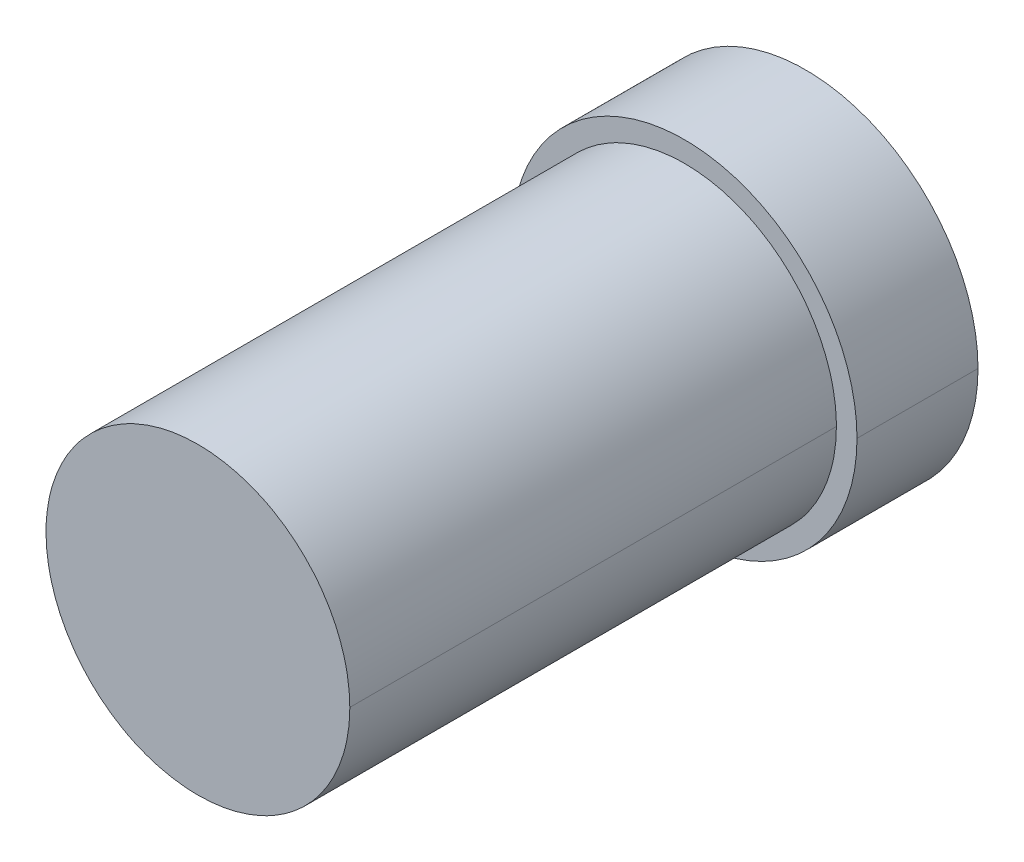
ISO-10303-21;
HEADER;
FILE_DESCRIPTION(('STEP AP214'),'2;1');
FILE_NAME('part.step','',(''),(''),'','','');
FILE_SCHEMA(('AUTOMOTIVE_DESIGN { 1 0 10303 214 1 1 1 1 }'));
ENDSEC;
DATA;
#1=APPLICATION_CONTEXT('core data for automotive mechanical design processes');
#2=APPLICATION_PROTOCOL_DEFINITION('international standard','automotive_design',2000,#1);
#3=PRODUCT_CONTEXT('',#1,'mechanical');
#4=PRODUCT('Part','Part','',(#3));
#5=PRODUCT_RELATED_PRODUCT_CATEGORY('part','',(#4));
#6=PRODUCT_DEFINITION_FORMATION('','',#4);
#7=PRODUCT_DEFINITION_CONTEXT('part definition',#1,'design');
#8=PRODUCT_DEFINITION('design','',#6,#7);
#9=PRODUCT_DEFINITION_SHAPE('','',#8);
#10=(LENGTH_UNIT() NAMED_UNIT(*) SI_UNIT(.MILLI.,.METRE.));
#11=(NAMED_UNIT(*) PLANE_ANGLE_UNIT() SI_UNIT($,.RADIAN.));
#12=(NAMED_UNIT(*) SI_UNIT($,.STERADIAN.) SOLID_ANGLE_UNIT());
#13=UNCERTAINTY_MEASURE_WITH_UNIT(LENGTH_MEASURE(1.E-05),#10,'distance_accuracy_value','');
#14=(GEOMETRIC_REPRESENTATION_CONTEXT(3) GLOBAL_UNCERTAINTY_ASSIGNED_CONTEXT((#13)) GLOBAL_UNIT_ASSIGNED_CONTEXT((#10,
#11,#12)) REPRESENTATION_CONTEXT('',''));
#15=CARTESIAN_POINT('',(0.,0.,0.));
#16=DIRECTION('',(0.,0.,1.));
#17=DIRECTION('',(1.,0.,0.));
#18=AXIS2_PLACEMENT_3D('',#15,#16,#17);
#19=CARTESIAN_POINT('',(0.,0.,0.));
#20=DIRECTION('',(0.,0.,-1.));
#21=DIRECTION('',(1.,0.,0.));
#22=AXIS2_PLACEMENT_3D('',#19,#20,#21);
#23=CYLINDRICAL_SURFACE('',#22,1.4986);
#24=CARTESIAN_POINT('',(1.4986,0.,-4.8006));
#25=CARTESIAN_POINT('',(1.49850818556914,-0.225984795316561,-4.8006));
#26=CARTESIAN_POINT('',(1.44665588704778,-0.45182495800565,-4.8006));
#27=CARTESIAN_POINT('',(1.25301254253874,-0.850183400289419,-4.8006));
#28=CARTESIAN_POINT('',(1.11518686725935,-1.02423853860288,-4.8006));
#29=CARTESIAN_POINT('',(0.785678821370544,-1.29299598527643,-4.8006));
#30=CARTESIAN_POINT('',(0.596551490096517,-1.39047270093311,-4.8006));
#31=CARTESIAN_POINT('',(0.15461742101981,-1.51143216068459,-4.8006));
#32=CARTESIAN_POINT('',(-0.103034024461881,-1.51582148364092,-4.8006));
#33=CARTESIAN_POINT('',(-0.579637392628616,-1.40269433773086,-4.8006));
#34=CARTESIAN_POINT('',(-0.799266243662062,-1.29012858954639,-4.8006));
#35=CARTESIAN_POINT('',(-1.15484097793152,-0.982389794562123,-4.8006));
#36=CARTESIAN_POINT('',(-1.29354431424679,-0.790957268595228,-4.8006));
#37=CARTESIAN_POINT('',(-1.45887692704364,-0.395859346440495,-4.8006));
#38=CARTESIAN_POINT('',(-1.49851956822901,-0.197968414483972,-4.8006));
#39=CARTESIAN_POINT('',(-1.4986,0.,-4.8006));
#40=B_SPLINE_CURVE_WITH_KNOTS('',3,(#24,#25,#26,#27,#28,#29,#30,#31,#32,#33,#34,#35,#36,#37,#38,
#39),.UNSPECIFIED.,.F.,.F.,(4,2,2,2,2,2,2,4),(0.,0.144,0.28224,0.4149504,0.57420288,
0.7270852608,0.873852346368,1.),.UNSPECIFIED.);
#41=CARTESIAN_POINT('',(1.4986,0.,-4.8006));
#42=VERTEX_POINT('',#41);
#43=CARTESIAN_POINT('',(-1.4986,0.,-4.8006));
#44=VERTEX_POINT('',#43);
#45=EDGE_CURVE('E24',#42,#44,#40,.T.);
#46=ORIENTED_EDGE('',*,*,#45,.F.);
#47=CARTESIAN_POINT('',(1.4986,0.,0.));
#48=CARTESIAN_POINT('',(1.4986,0.,-0.040005));
#49=CARTESIAN_POINT('',(1.4986,0.,-0.08001));
#50=CARTESIAN_POINT('',(1.4986,0.,-0.16002));
#51=CARTESIAN_POINT('',(1.4986,0.,-0.200025));
#52=CARTESIAN_POINT('',(1.4986,0.,-0.280035));
#53=CARTESIAN_POINT('',(1.4986,0.,-0.32004));
#54=CARTESIAN_POINT('',(1.4986,0.,-0.40005));
#55=CARTESIAN_POINT('',(1.4986,0.,-0.440055));
#56=CARTESIAN_POINT('',(1.4986,0.,-0.520065));
#57=CARTESIAN_POINT('',(1.4986,0.,-0.56007));
#58=CARTESIAN_POINT('',(1.4986,0.,-0.64008));
#59=CARTESIAN_POINT('',(1.4986,0.,-0.680085));
#60=CARTESIAN_POINT('',(1.4986,0.,-0.760095));
#61=CARTESIAN_POINT('',(1.4986,0.,-0.8001));
#62=CARTESIAN_POINT('',(1.4986,0.,-0.88011));
#63=CARTESIAN_POINT('',(1.4986,0.,-0.920115));
#64=CARTESIAN_POINT('',(1.4986,0.,-1.000125));
#65=CARTESIAN_POINT('',(1.4986,0.,-1.04013));
#66=CARTESIAN_POINT('',(1.4986,0.,-1.12014));
#67=CARTESIAN_POINT('',(1.4986,0.,-1.160145));
#68=CARTESIAN_POINT('',(1.4986,0.,-1.240155));
#69=CARTESIAN_POINT('',(1.4986,0.,-1.28016));
#70=CARTESIAN_POINT('',(1.4986,0.,-1.36017));
#71=CARTESIAN_POINT('',(1.4986,0.,-1.400175));
#72=CARTESIAN_POINT('',(1.4986,0.,-1.480185));
#73=CARTESIAN_POINT('',(1.4986,0.,-1.52019));
#74=CARTESIAN_POINT('',(1.4986,0.,-1.6002));
#75=CARTESIAN_POINT('',(1.4986,0.,-1.640205));
#76=CARTESIAN_POINT('',(1.4986,0.,-1.720215));
#77=CARTESIAN_POINT('',(1.4986,0.,-1.76022));
#78=CARTESIAN_POINT('',(1.4986,0.,-1.84023));
#79=CARTESIAN_POINT('',(1.4986,0.,-1.880235));
#80=CARTESIAN_POINT('',(1.4986,0.,-1.960245));
#81=CARTESIAN_POINT('',(1.4986,0.,-2.00025));
#82=CARTESIAN_POINT('',(1.4986,0.,-2.08026));
#83=CARTESIAN_POINT('',(1.4986,0.,-2.120265));
#84=CARTESIAN_POINT('',(1.4986,0.,-2.200275));
#85=CARTESIAN_POINT('',(1.4986,0.,-2.24028));
#86=CARTESIAN_POINT('',(1.4986,0.,-2.32029));
#87=CARTESIAN_POINT('',(1.4986,0.,-2.360295));
#88=CARTESIAN_POINT('',(1.4986,0.,-2.440305));
#89=CARTESIAN_POINT('',(1.4986,0.,-2.48031));
#90=CARTESIAN_POINT('',(1.4986,0.,-2.56032));
#91=CARTESIAN_POINT('',(1.4986,0.,-2.600325));
#92=CARTESIAN_POINT('',(1.4986,0.,-2.680335));
#93=CARTESIAN_POINT('',(1.4986,0.,-2.72034));
#94=CARTESIAN_POINT('',(1.4986,0.,-2.80035));
#95=CARTESIAN_POINT('',(1.4986,0.,-2.840355));
#96=CARTESIAN_POINT('',(1.4986,0.,-2.920365));
#97=CARTESIAN_POINT('',(1.4986,0.,-2.96037));
#98=CARTESIAN_POINT('',(1.4986,0.,-3.04038));
#99=CARTESIAN_POINT('',(1.4986,0.,-3.080385));
#100=CARTESIAN_POINT('',(1.4986,0.,-3.160395));
#101=CARTESIAN_POINT('',(1.4986,0.,-3.2004));
#102=CARTESIAN_POINT('',(1.4986,0.,-3.28041));
#103=CARTESIAN_POINT('',(1.4986,0.,-3.320415));
#104=CARTESIAN_POINT('',(1.4986,0.,-3.400425));
#105=CARTESIAN_POINT('',(1.4986,0.,-3.44043));
#106=CARTESIAN_POINT('',(1.4986,0.,-3.52044));
#107=CARTESIAN_POINT('',(1.4986,0.,-3.560445));
#108=CARTESIAN_POINT('',(1.4986,0.,-3.640455));
#109=CARTESIAN_POINT('',(1.4986,0.,-3.68046));
#110=CARTESIAN_POINT('',(1.4986,0.,-3.76047));
#111=CARTESIAN_POINT('',(1.4986,0.,-3.800475));
#112=CARTESIAN_POINT('',(1.4986,0.,-3.880485));
#113=CARTESIAN_POINT('',(1.4986,0.,-3.92049));
#114=CARTESIAN_POINT('',(1.4986,0.,-4.0005));
#115=CARTESIAN_POINT('',(1.4986,0.,-4.040505));
#116=CARTESIAN_POINT('',(1.4986,0.,-4.120515));
#117=CARTESIAN_POINT('',(1.4986,0.,-4.16052));
#118=CARTESIAN_POINT('',(1.4986,0.,-4.24053));
#119=CARTESIAN_POINT('',(1.4986,0.,-4.280535));
#120=CARTESIAN_POINT('',(1.4986,0.,-4.360545));
#121=CARTESIAN_POINT('',(1.4986,0.,-4.40055));
#122=CARTESIAN_POINT('',(1.4986,0.,-4.48056));
#123=CARTESIAN_POINT('',(1.4986,0.,-4.520565));
#124=CARTESIAN_POINT('',(1.4986,0.,-4.600575));
#125=CARTESIAN_POINT('',(1.4986,0.,-4.64058));
#126=CARTESIAN_POINT('',(1.4986,0.,-4.72059));
#127=CARTESIAN_POINT('',(1.4986,0.,-4.760595));
#128=CARTESIAN_POINT('',(1.4986,0.,-4.8006));
#129=B_SPLINE_CURVE_WITH_KNOTS('',3,(#47,#48,#49,#50,#51,#52,#53,#54,#55,#56,#57,#58,#59,#60,
#61,#62,#63,#64,#65,#66,#67,#68,#69,#70,#71,#72,#73,#74,#75,#76,#77,#78,#79,#80,#81,#82,#83,#84,
#85,#86,#87,#88,#89,#90,#91,#92,#93,#94,#95,#96,#97,#98,#99,#100,#101,#102,#103,#104,#105,#106,
#107,#108,#109,#110,#111,#112,#113,#114,#115,#116,#117,#118,#119,#120,#121,#122,#123,#124,#125,
#126,#127,#128),.UNSPECIFIED.,.F.,.F.,(4,2,2,2,2,2,2,2,2,2,2,2,2,2,2,2,2,2,2,2,2,2,2,2,2,2,2,2,
2,2,2,2,2,2,2,2,2,2,2,2,4),(0.,0.120015,0.24003,0.360045,0.48006,0.600075,0.72009,0.840105,
0.96012,1.080135,1.20015,1.320165,1.44018,1.560195,1.68021,1.800225,1.92024,2.040255,2.16027,
2.280285,2.4003,2.520315,2.64033,2.760345,2.88036,3.000375,3.12039,3.240405,3.36042,3.480435,
3.60045,3.720465,3.84048,3.960495,4.08051,4.200525,4.32054,4.440555,4.56057,4.680585,4.8006),.UNSPECIFIED.);
#130=CARTESIAN_POINT('',(1.4986,0.,0.));
#131=VERTEX_POINT('',#130);
#132=EDGE_CURVE('E33',#131,#42,#129,.T.);
#133=ORIENTED_EDGE('',*,*,#132,.F.);
#134=CARTESIAN_POINT('',(-1.4986,0.,0.));
#135=CARTESIAN_POINT('',(-1.49850818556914,-0.225984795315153,0.));
#136=CARTESIAN_POINT('',(-1.44665588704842,-0.451824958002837,0.));
#137=CARTESIAN_POINT('',(-1.25301254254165,-0.850183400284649,0.));
#138=CARTESIAN_POINT('',(-1.11518686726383,-1.02423853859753,0.));
#139=CARTESIAN_POINT('',(-0.785678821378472,-1.29299598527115,0.));
#140=CARTESIAN_POINT('',(-0.596551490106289,-1.39047270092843,0.));
#141=CARTESIAN_POINT('',(-0.154617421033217,-1.51143216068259,0.));
#142=CARTESIAN_POINT('',(0.103034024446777,-1.51582148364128,0.));
#143=CARTESIAN_POINT('',(0.579637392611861,-1.40269433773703,0.));
#144=CARTESIAN_POINT('',(0.799266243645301,-1.29012858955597,0.));
#145=CARTESIAN_POINT('',(1.15484097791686,-0.982389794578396,0.));
#146=CARTESIAN_POINT('',(1.29354431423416,-0.7909572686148,0.));
#147=CARTESIAN_POINT('',(1.45887692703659,-0.395859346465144,0.));
#148=CARTESIAN_POINT('',(1.4985195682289,-0.197968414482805,0.));
#149=CARTESIAN_POINT('',(1.4986,0.,0.));
#150=B_SPLINE_CURVE_WITH_KNOTS('',3,(#134,#135,#136,#137,#138,#139,#140,#141,#142,#143,#144,
#145,#146,#147,#148,#149),.UNSPECIFIED.,.F.,.F.,(4,2,2,2,2,2,2,4),(0.,0.144,0.28224,0.4149504,
0.57420288,0.7270852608,0.873852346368,1.),.UNSPECIFIED.);
#151=CARTESIAN_POINT('',(-1.4986,0.,0.));
#152=VERTEX_POINT('',#151);
#153=EDGE_CURVE('E83',#152,#131,#150,.T.);
#154=ORIENTED_EDGE('',*,*,#153,.F.);
#155=CARTESIAN_POINT('',(-1.4986,0.,0.));
#156=CARTESIAN_POINT('',(-1.4986,0.,-0.040005));
#157=CARTESIAN_POINT('',(-1.4986,0.,-0.08001));
#158=CARTESIAN_POINT('',(-1.4986,0.,-0.16002));
#159=CARTESIAN_POINT('',(-1.4986,0.,-0.200025));
#160=CARTESIAN_POINT('',(-1.4986,0.,-0.280035));
#161=CARTESIAN_POINT('',(-1.4986,0.,-0.32004));
#162=CARTESIAN_POINT('',(-1.4986,0.,-0.40005));
#163=CARTESIAN_POINT('',(-1.4986,0.,-0.440055));
#164=CARTESIAN_POINT('',(-1.4986,0.,-0.520065));
#165=CARTESIAN_POINT('',(-1.4986,0.,-0.56007));
#166=CARTESIAN_POINT('',(-1.4986,0.,-0.64008));
#167=CARTESIAN_POINT('',(-1.4986,0.,-0.680085));
#168=CARTESIAN_POINT('',(-1.4986,0.,-0.760095));
#169=CARTESIAN_POINT('',(-1.4986,0.,-0.8001));
#170=CARTESIAN_POINT('',(-1.4986,0.,-0.88011));
#171=CARTESIAN_POINT('',(-1.4986,0.,-0.920115));
#172=CARTESIAN_POINT('',(-1.4986,0.,-1.000125));
#173=CARTESIAN_POINT('',(-1.4986,0.,-1.04013));
#174=CARTESIAN_POINT('',(-1.4986,0.,-1.12014));
#175=CARTESIAN_POINT('',(-1.4986,0.,-1.160145));
#176=CARTESIAN_POINT('',(-1.4986,0.,-1.240155));
#177=CARTESIAN_POINT('',(-1.4986,0.,-1.28016));
#178=CARTESIAN_POINT('',(-1.4986,0.,-1.36017));
#179=CARTESIAN_POINT('',(-1.4986,0.,-1.400175));
#180=CARTESIAN_POINT('',(-1.4986,0.,-1.480185));
#181=CARTESIAN_POINT('',(-1.4986,0.,-1.52019));
#182=CARTESIAN_POINT('',(-1.4986,0.,-1.6002));
#183=CARTESIAN_POINT('',(-1.4986,0.,-1.640205));
#184=CARTESIAN_POINT('',(-1.4986,0.,-1.720215));
#185=CARTESIAN_POINT('',(-1.4986,0.,-1.76022));
#186=CARTESIAN_POINT('',(-1.4986,0.,-1.84023));
#187=CARTESIAN_POINT('',(-1.4986,0.,-1.880235));
#188=CARTESIAN_POINT('',(-1.4986,0.,-1.960245));
#189=CARTESIAN_POINT('',(-1.4986,0.,-2.00025));
#190=CARTESIAN_POINT('',(-1.4986,0.,-2.08026));
#191=CARTESIAN_POINT('',(-1.4986,0.,-2.120265));
#192=CARTESIAN_POINT('',(-1.4986,0.,-2.200275));
#193=CARTESIAN_POINT('',(-1.4986,0.,-2.24028));
#194=CARTESIAN_POINT('',(-1.4986,0.,-2.32029));
#195=CARTESIAN_POINT('',(-1.4986,0.,-2.360295));
#196=CARTESIAN_POINT('',(-1.4986,0.,-2.440305));
#197=CARTESIAN_POINT('',(-1.4986,0.,-2.48031));
#198=CARTESIAN_POINT('',(-1.4986,0.,-2.56032));
#199=CARTESIAN_POINT('',(-1.4986,0.,-2.600325));
#200=CARTESIAN_POINT('',(-1.4986,0.,-2.680335));
#201=CARTESIAN_POINT('',(-1.4986,0.,-2.72034));
#202=CARTESIAN_POINT('',(-1.4986,0.,-2.80035));
#203=CARTESIAN_POINT('',(-1.4986,0.,-2.840355));
#204=CARTESIAN_POINT('',(-1.4986,0.,-2.920365));
#205=CARTESIAN_POINT('',(-1.4986,0.,-2.96037));
#206=CARTESIAN_POINT('',(-1.4986,0.,-3.04038));
#207=CARTESIAN_POINT('',(-1.4986,0.,-3.080385));
#208=CARTESIAN_POINT('',(-1.4986,0.,-3.160395));
#209=CARTESIAN_POINT('',(-1.4986,0.,-3.2004));
#210=CARTESIAN_POINT('',(-1.4986,0.,-3.28041));
#211=CARTESIAN_POINT('',(-1.4986,0.,-3.320415));
#212=CARTESIAN_POINT('',(-1.4986,0.,-3.400425));
#213=CARTESIAN_POINT('',(-1.4986,0.,-3.44043));
#214=CARTESIAN_POINT('',(-1.4986,0.,-3.52044));
#215=CARTESIAN_POINT('',(-1.4986,0.,-3.560445));
#216=CARTESIAN_POINT('',(-1.4986,0.,-3.640455));
#217=CARTESIAN_POINT('',(-1.4986,0.,-3.68046));
#218=CARTESIAN_POINT('',(-1.4986,0.,-3.76047));
#219=CARTESIAN_POINT('',(-1.4986,0.,-3.800475));
#220=CARTESIAN_POINT('',(-1.4986,0.,-3.880485));
#221=CARTESIAN_POINT('',(-1.4986,0.,-3.92049));
#222=CARTESIAN_POINT('',(-1.4986,0.,-4.0005));
#223=CARTESIAN_POINT('',(-1.4986,0.,-4.040505));
#224=CARTESIAN_POINT('',(-1.4986,0.,-4.120515));
#225=CARTESIAN_POINT('',(-1.4986,0.,-4.16052));
#226=CARTESIAN_POINT('',(-1.4986,0.,-4.24053));
#227=CARTESIAN_POINT('',(-1.4986,0.,-4.280535));
#228=CARTESIAN_POINT('',(-1.4986,0.,-4.360545));
#229=CARTESIAN_POINT('',(-1.4986,0.,-4.40055));
#230=CARTESIAN_POINT('',(-1.4986,0.,-4.48056));
#231=CARTESIAN_POINT('',(-1.4986,0.,-4.520565));
#232=CARTESIAN_POINT('',(-1.4986,0.,-4.600575));
#233=CARTESIAN_POINT('',(-1.4986,0.,-4.64058));
#234=CARTESIAN_POINT('',(-1.4986,0.,-4.72059));
#235=CARTESIAN_POINT('',(-1.4986,0.,-4.760595));
#236=CARTESIAN_POINT('',(-1.4986,0.,-4.8006));
#237=B_SPLINE_CURVE_WITH_KNOTS('',3,(#155,#156,#157,#158,#159,#160,#161,#162,#163,#164,#165,
#166,#167,#168,#169,#170,#171,#172,#173,#174,#175,#176,#177,#178,#179,#180,#181,#182,#183,#184,
#185,#186,#187,#188,#189,#190,#191,#192,#193,#194,#195,#196,#197,#198,#199,#200,#201,#202,#203,
#204,#205,#206,#207,#208,#209,#210,#211,#212,#213,#214,#215,#216,#217,#218,#219,#220,#221,#222,
#223,#224,#225,#226,#227,#228,#229,#230,#231,#232,#233,#234,#235,#236),.UNSPECIFIED.,.F.,.F.,(4,
2,2,2,2,2,2,2,2,2,2,2,2,2,2,2,2,2,2,2,2,2,2,2,2,2,2,2,2,2,2,2,2,2,2,2,2,2,2,2,4),(0.,0.120015,
0.24003,0.360045,0.48006,0.600075,0.72009,0.840105,0.96012,1.080135,1.20015,1.320165,1.44018,
1.560195,1.68021,1.800225,1.92024,2.040255,2.16027,2.280285,2.4003,2.520315,2.64033,2.760345,
2.88036,3.000375,3.12039,3.240405,3.36042,3.480435,3.60045,3.720465,3.84048,3.960495,4.08051,
4.200525,4.32054,4.440555,4.56057,4.680585,4.8006),.UNSPECIFIED.);
#238=EDGE_CURVE('E10',#152,#44,#237,.T.);
#239=ORIENTED_EDGE('',*,*,#238,.T.);
#240=EDGE_LOOP('',(#46,#133,#154,#239));
#241=FACE_BOUND('',#240,.T.);
#242=ADVANCED_FACE('F15',(#241),#23,.T.);
#243=CARTESIAN_POINT('',(-1.7018,-1.74983816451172,-4.8006));
#244=DIRECTION('',(0.,0.,1.));
#245=DIRECTION('',(1.,0.,0.));
#246=AXIS2_PLACEMENT_3D('',#243,#244,#245);
#247=PLANE('',#246);
#248=CARTESIAN_POINT('',(1.7018,0.,-4.8006));
#249=CARTESIAN_POINT('',(1.70180059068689,-0.0278458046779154,-4.8006));
#250=CARTESIAN_POINT('',(1.70111657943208,-0.0556915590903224,-4.8006));
#251=CARTESIAN_POINT('',(1.69838359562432,-0.111315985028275,-4.8006));
#252=CARTESIAN_POINT('',(1.69633462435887,-0.139094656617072,-4.8006));
#253=CARTESIAN_POINT('',(1.69087596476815,-0.194517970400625,-4.8006));
#254=CARTESIAN_POINT('',(1.68746627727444,-0.222162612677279,-4.8006));
#255=CARTESIAN_POINT('',(1.67929458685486,-0.277251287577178,-4.8006));
#256=CARTESIAN_POINT('',(1.67453258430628,-0.304695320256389,-4.8006));
#257=CARTESIAN_POINT('',(1.66366768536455,-0.359316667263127,-4.8006));
#258=CARTESIAN_POINT('',(1.65756478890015,-0.38649398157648,-4.8006));
#259=CARTESIAN_POINT('',(1.64403281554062,-0.44051642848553,-4.8006));
#260=CARTESIAN_POINT('',(1.63660373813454,-0.467361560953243,-4.8006));
#261=CARTESIAN_POINT('',(1.620437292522,-0.52065497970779,-4.8006));
#262=CARTESIAN_POINT('',(1.61169992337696,-0.547103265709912,-4.8006));
#263=CARTESIAN_POINT('',(1.59293794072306,-0.599539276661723,-4.8006));
#264=CARTESIAN_POINT('',(1.5829133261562,-0.625527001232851,-4.8006));
#265=CARTESIAN_POINT('',(1.56160102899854,-0.67697920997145,-4.8006));
#266=CARTESIAN_POINT('',(1.55031334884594,-0.702443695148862,-4.8006));
#267=CARTESIAN_POINT('',(1.52650212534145,-0.752788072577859,-4.8006));
#268=CARTESIAN_POINT('',(1.51397858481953,-0.777667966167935,-4.8006));
#269=CARTESIAN_POINT('',(1.48772581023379,-0.826783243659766,-4.8006));
#270=CARTESIAN_POINT('',(1.47399657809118,-0.851018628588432,-4.8006));
#271=CARTESIAN_POINT('',(1.44536549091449,-0.898786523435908,-4.8006));
#272=CARTESIAN_POINT('',(1.43046363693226,-0.922319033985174,-4.8006));
#273=CARTESIAN_POINT('',(1.3995231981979,-0.968624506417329,-4.8006));
#274=CARTESIAN_POINT('',(1.38348461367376,-0.991397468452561,-4.8006));
#275=CARTESIAN_POINT('',(1.35030934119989,-1.03612899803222,-4.8006));
#276=CARTESIAN_POINT('',(1.33317265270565,-1.05808756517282,-4.8006));
#277=CARTESIAN_POINT('',(1.29784244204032,-1.10113741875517,-4.8006));
#278=CARTESIAN_POINT('',(1.27964891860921,-1.12222870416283,-4.8006));
#279=CARTESIAN_POINT('',(1.24224885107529,-1.16349319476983,-4.8006));
#280=CARTESIAN_POINT('',(1.22304230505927,-1.1836663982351,-4.8006));
#281=CARTESIAN_POINT('',(1.18366244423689,-1.22304613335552,-4.8006));
#282=CARTESIAN_POINT('',(1.16348912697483,-1.24225266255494,-4.8006));
#283=CARTESIAN_POINT('',(1.12222440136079,-1.27965269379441,-4.8006));
#284=CARTESIAN_POINT('',(1.10113299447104,-1.29784619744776,-4.8006));
#285=CARTESIAN_POINT('',(1.05808295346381,-1.33317631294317,-4.8006));
#286=CARTESIAN_POINT('',(1.0361243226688,-1.35031292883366,-4.8006));
#287=CARTESIAN_POINT('',(0.991392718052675,-1.38348801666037,-4.8006));
#288=CARTESIAN_POINT('',(0.968619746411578,-1.399526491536,-4.8006));
#289=CARTESIAN_POINT('',(0.922314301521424,-1.43046668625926,-4.8006));
#290=CARTESIAN_POINT('',(0.898781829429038,-1.44536840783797,-4.8006));
#291=CARTESIAN_POINT('',(0.851014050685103,-1.4739992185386,-4.8006));
#292=CARTESIAN_POINT('',(0.826778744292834,-1.48772830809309,-4.8006));
#293=CARTESIAN_POINT('',(0.777663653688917,-1.5139807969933,-4.8006));
#294=CARTESIAN_POINT('',(0.752783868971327,-1.52650419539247,-4.8006));
#295=CARTESIAN_POINT('',(0.702439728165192,-1.55031514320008,-4.8006));
#296=CARTESIAN_POINT('',(0.676975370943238,-1.56160269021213,-4.8006));
#297=CARTESIAN_POINT('',(0.62552339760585,-1.58291474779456,-4.8006));
#298=CARTESIAN_POINT('',(0.599535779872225,-1.59293925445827,-4.8006));
#299=CARTESIAN_POINT('',(0.547099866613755,-1.61170107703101,-4.8006));
#300=CARTESIAN_POINT('',(0.520651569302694,-1.62043838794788,-4.8006));
#301=CARTESIAN_POINT('',(0.467358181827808,-1.63660470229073,-4.8006));
#302=CARTESIAN_POINT('',(0.440513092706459,-1.64403370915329,-4.8006));
#303=CARTESIAN_POINT('',(0.386490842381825,-1.65756551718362,-4.8006));
#304=CARTESIAN_POINT('',(0.35931368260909,-1.66366832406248,-4.8006));
#305=CARTESIAN_POINT('',(0.304692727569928,-1.67453305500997,-4.8006));
#306=CARTESIAN_POINT('',(0.277248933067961,-1.67929498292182,-4.8006));
#307=CARTESIAN_POINT('',(0.222160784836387,-1.68746650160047,-4.8006));
#308=CARTESIAN_POINT('',(0.194516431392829,-1.69087609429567,-4.8006));
#309=CARTESIAN_POINT('',(0.139093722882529,-1.69633473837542,-4.8006));
#310=CARTESIAN_POINT('',(0.111315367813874,-1.69838378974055,-4.8006));
#311=CARTESIAN_POINT('',(0.0556915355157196,-1.70111641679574,-4.8006));
#312=CARTESIAN_POINT('',(0.0278460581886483,-1.70179999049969,-4.8006));
#313=CARTESIAN_POINT('',(-0.027844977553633,-1.70180000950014,-4.8006));
#314=CARTESIAN_POINT('',(-0.0556905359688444,-1.70111645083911,-4.8006));
#315=CARTESIAN_POINT('',(-0.111314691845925,-1.69838383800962,-4.8006));
#316=CARTESIAN_POINT('',(-0.139093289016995,-1.69633477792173,-4.8006));
#317=CARTESIAN_POINT('',(-0.194516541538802,-1.69087608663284,-4.8006));
#318=CARTESIAN_POINT('',(-0.222161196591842,-1.68746645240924,-4.8006));
#319=CARTESIAN_POINT('',(-0.277249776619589,-1.6792948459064,-4.8006));
#320=CARTESIAN_POINT('',(-0.30469370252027,-1.67453287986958,-4.8006));
#321=CARTESIAN_POINT('',(-0.35931474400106,-1.66366809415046,-4.8006));
#322=CARTESIAN_POINT('',(-0.386491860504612,-1.65756527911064,-4.8006));
#323=CARTESIAN_POINT('',(-0.440513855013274,-1.64403350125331,-4.8006));
#324=CARTESIAN_POINT('',(-0.467358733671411,-1.63660454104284,-4.8006));
#325=CARTESIAN_POINT('',(-0.520651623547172,-1.62043836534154,-4.8006));
#326=CARTESIAN_POINT('',(-0.547099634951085,-1.61170115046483,-4.8006));
#327=CARTESIAN_POINT('',(-0.59953511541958,-1.59293950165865,-4.8006));
#328=CARTESIAN_POINT('',(-0.625522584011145,-1.58291506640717,-4.8006));
#329=CARTESIAN_POINT('',(-0.676974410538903,-1.56160310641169,-4.8006));
#330=CARTESIAN_POINT('',(-0.702438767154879,-1.55031557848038,-4.8006));
#331=CARTESIAN_POINT('',(-0.752783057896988,-1.5265045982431,-4.8006));
#332=CARTESIAN_POINT('',(-0.777662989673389,-1.51398114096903,-4.8006));
#333=CARTESIAN_POINT('',(-0.826778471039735,-1.48772846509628,-4.8006));
#334=CARTESIAN_POINT('',(-0.851014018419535,-1.47399924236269,-4.8006));
#335=CARTESIAN_POINT('',(-0.898782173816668,-1.44536819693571,-4.8006));
#336=CARTESIAN_POINT('',(-0.92231478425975,-1.43046637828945,-4.8006));
#337=CARTESIAN_POINT('',(-0.968620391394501,-1.39952604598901,-4.8006));
#338=CARTESIAN_POINT('',(-0.991393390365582,-1.38348753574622,-4.8006));
#339=CARTESIAN_POINT('',(-1.03612494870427,-1.35031244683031,-4.8006));
#340=CARTESIAN_POINT('',(-1.05808350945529,-1.33317587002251,-4.8006));
#341=CARTESIAN_POINT('',(-1.10113332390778,-1.29784591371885,-4.8006));
#342=CARTESIAN_POINT('',(-1.122224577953,-1.27965253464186,-4.8006));
#343=CARTESIAN_POINT('',(-1.16348899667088,-1.24225277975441,-4.8006));
#344=CARTESIAN_POINT('',(-1.18366216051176,-1.22304640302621,-4.8006));
#345=CARTESIAN_POINT('',(-1.22304182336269,-1.18366689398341,-4.8006));
#346=CARTESIAN_POINT('',(-1.24224832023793,-1.16349375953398,-4.8006));
#347=CARTESIAN_POINT('',(-1.27964839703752,-1.12222930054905,-4.8006));
#348=CARTESIAN_POINT('',(-1.29784197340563,-1.10113797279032,-4.8006));
#349=CARTESIAN_POINT('',(-1.33317234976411,-1.05808795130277,-4.8006));
#350=CARTESIAN_POINT('',(-1.35030914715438,-1.03612925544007,-4.8006));
#351=CARTESIAN_POINT('',(-1.3834846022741,-0.991397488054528,-4.8006));
#352=CARTESIAN_POINT('',(-1.39952326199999,-0.968624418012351,-4.8006));
#353=CARTESIAN_POINT('',(-1.43046381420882,-0.922318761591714,-4.8006));
#354=CARTESIAN_POINT('',(-1.44536570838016,-0.898786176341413,-4.8006));
#355=CARTESIAN_POINT('',(-1.47399684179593,-0.851018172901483,-4.8006));
#356=CARTESIAN_POINT('',(-1.4877260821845,-0.826782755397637,-4.8006));
#357=CARTESIAN_POINT('',(-1.51397884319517,-0.777667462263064,-4.8006));
#358=CARTESIAN_POINT('',(-1.52650236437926,-0.752787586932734,-4.8006));
#359=CARTESIAN_POINT('',(-1.55031352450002,-0.702443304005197,-4.8006));
#360=CARTESIAN_POINT('',(-1.56160116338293,-0.676978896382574,-4.8006));
#361=CARTESIAN_POINT('',(-1.58291337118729,-0.62552688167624,-4.8006));
#362=CARTESIAN_POINT('',(-1.59293793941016,-0.599539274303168,-4.8006));
#363=CARTESIAN_POINT('',(-1.61169985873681,-0.547103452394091,-4.8006));
#364=CARTESIAN_POINT('',(-1.62043720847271,-0.520655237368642,-4.8006));
#365=CARTESIAN_POINT('',(-1.63660364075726,-0.467361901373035,-4.8006));
#366=CARTESIAN_POINT('',(-1.64403272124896,-0.440516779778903,-4.8006));
#367=CARTESIAN_POINT('',(-1.65756471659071,-0.386494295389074,-4.8006));
#368=CARTESIAN_POINT('',(-1.66366762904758,-0.359316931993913,-4.8006));
#369=CARTESIAN_POINT('',(-1.67453255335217,-0.304695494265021,-4.8006));
#370=CARTESIAN_POINT('',(-1.679294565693,-0.277251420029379,-4.8006));
#371=CARTESIAN_POINT('',(-1.68746626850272,-0.22216268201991,-4.8006));
#372=CARTESIAN_POINT('',(-1.6908759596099,-0.194518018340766,-4.8006));
#373=CARTESIAN_POINT('',(-1.69633462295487,-0.139094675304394,-4.8006));
#374=CARTESIAN_POINT('',(-1.69838359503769,-0.111315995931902,-4.8006));
#375=CARTESIAN_POINT('',(-1.70111657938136,-0.0556915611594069,-4.8006));
#376=CARTESIAN_POINT('',(-1.70180059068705,-0.0278458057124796,-4.8006));
#377=CARTESIAN_POINT('',(-1.7018,0.,-4.8006));
#378=B_SPLINE_CURVE_WITH_KNOTS('',3,(#248,#249,#250,#251,#252,#253,#254,#255,#256,#257,#258,
#259,#260,#261,#262,#263,#264,#265,#266,#267,#268,#269,#270,#271,#272,#273,#274,#275,#276,#277,
#278,#279,#280,#281,#282,#283,#284,#285,#286,#287,#288,#289,#290,#291,#292,#293,#294,#295,#296,
#297,#298,#299,#300,#301,#302,#303,#304,#305,#306,#307,#308,#309,#310,#311,#312,#313,#314,#315,
#316,#317,#318,#319,#320,#321,#322,#323,#324,#325,#326,#327,#328,#329,#330,#331,#332,#333,#334,
#335,#336,#337,#338,#339,#340,#341,#342,#343,#344,#345,#346,#347,#348,#349,#350,#351,#352,#353,
#354,#355,#356,#357,#358,#359,#360,#361,#362,#363,#364,#365,#366,#367,#368,#369,#370,#371,#372,
#373,#374,#375,#376,#377),.UNSPECIFIED.,.F.,.F.,(4,2,2,2,2,2,2,2,2,2,2,2,2,2,2,2,2,2,2,2,2,2,2,
2,2,2,2,2,2,2,2,2,2,2,2,2,2,2,2,2,2,2,2,2,2,2,2,2,2,2,2,2,2,2,2,2,2,2,2,2,2,2,2,2,4),(0.,
0.0835289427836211,0.167057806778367,0.250586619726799,0.334115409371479,0.417644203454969,
0.50117302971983,0.584701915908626,0.668230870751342,0.751759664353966,0.835288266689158,
0.918816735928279,1.00234513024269,1.08587350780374,1.16940192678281,1.25293044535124,
1.33645912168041,1.41998801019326,1.50351676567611,1.58704520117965,1.67057341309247,
1.75410149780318,1.83762955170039,1.92115767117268,2.00468595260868,2.08821449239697,
2.171743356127,2.25527200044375,2.33880028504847,2.42232833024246,2.505856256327,
2.5893841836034,2.67291223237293,2.7564405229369,2.83996917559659,2.92349801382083,
3.00702646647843,3.09055462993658,3.17408262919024,3.25761058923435,3.34113863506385,
3.4246668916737,3.50819548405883,3.59172436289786,3.67525295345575,3.75878129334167,
3.84230949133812,3.92583765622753,4.0093658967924,4.09289432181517,4.17642304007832,
4.25995196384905,4.34348073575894,4.42700938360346,4.51053794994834,4.59406647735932,
4.67759500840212,4.76112358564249,4.84465225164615,4.92818104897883,5.01170999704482,
5.09523891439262,5.17876779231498,5.2622966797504,5.34582562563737),.UNSPECIFIED.);
#379=CARTESIAN_POINT('',(1.7018,0.,-4.8006));
#380=VERTEX_POINT('',#379);
#381=CARTESIAN_POINT('',(-1.7018,0.,-4.8006));
#382=VERTEX_POINT('',#381);
#383=EDGE_CURVE('E63',#380,#382,#378,.T.);
#384=ORIENTED_EDGE('',*,*,#383,.F.);
#385=CARTESIAN_POINT('',(-1.7018,0.,-4.8006));
#386=CARTESIAN_POINT('',(-1.70180059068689,0.0278458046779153,-4.8006));
#387=CARTESIAN_POINT('',(-1.70111657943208,0.0556915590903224,-4.8006));
#388=CARTESIAN_POINT('',(-1.69838359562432,0.111315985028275,-4.8006));
#389=CARTESIAN_POINT('',(-1.69633462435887,0.139094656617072,-4.8006));
#390=CARTESIAN_POINT('',(-1.69087596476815,0.194517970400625,-4.8006));
#391=CARTESIAN_POINT('',(-1.68746627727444,0.222162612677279,-4.8006));
#392=CARTESIAN_POINT('',(-1.67929458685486,0.277251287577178,-4.8006));
#393=CARTESIAN_POINT('',(-1.67453258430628,0.30469532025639,-4.8006));
#394=CARTESIAN_POINT('',(-1.66366768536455,0.359316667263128,-4.8006));
#395=CARTESIAN_POINT('',(-1.65756478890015,0.386493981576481,-4.8006));
#396=CARTESIAN_POINT('',(-1.64403281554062,0.440516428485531,-4.8006));
#397=CARTESIAN_POINT('',(-1.63660373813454,0.467361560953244,-4.8006));
#398=CARTESIAN_POINT('',(-1.620437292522,0.520654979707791,-4.8006));
#399=CARTESIAN_POINT('',(-1.61169992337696,0.547103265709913,-4.8006));
#400=CARTESIAN_POINT('',(-1.59293794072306,0.599539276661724,-4.8006));
#401=CARTESIAN_POINT('',(-1.5829133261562,0.625527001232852,-4.8006));
#402=CARTESIAN_POINT('',(-1.56160102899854,0.676979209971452,-4.8006));
#403=CARTESIAN_POINT('',(-1.55031334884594,0.702443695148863,-4.8006));
#404=CARTESIAN_POINT('',(-1.52650212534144,0.75278807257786,-4.8006));
#405=CARTESIAN_POINT('',(-1.51397858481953,0.777667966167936,-4.8006));
#406=CARTESIAN_POINT('',(-1.48772581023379,0.826783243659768,-4.8006));
#407=CARTESIAN_POINT('',(-1.47399657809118,0.851018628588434,-4.8006));
#408=CARTESIAN_POINT('',(-1.44536549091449,0.89878652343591,-4.8006));
#409=CARTESIAN_POINT('',(-1.43046363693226,0.922319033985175,-4.8006));
#410=CARTESIAN_POINT('',(-1.3995231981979,0.968624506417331,-4.8006));
#411=CARTESIAN_POINT('',(-1.38348461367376,0.991397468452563,-4.8006));
#412=CARTESIAN_POINT('',(-1.35030934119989,1.03612899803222,-4.8006));
#413=CARTESIAN_POINT('',(-1.33317265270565,1.05808756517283,-4.8006));
#414=CARTESIAN_POINT('',(-1.29784244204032,1.10113741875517,-4.8006));
#415=CARTESIAN_POINT('',(-1.2796489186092,1.12222870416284,-4.8006));
#416=CARTESIAN_POINT('',(-1.24224885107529,1.16349319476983,-4.8006));
#417=CARTESIAN_POINT('',(-1.22304230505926,1.18366639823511,-4.8006));
#418=CARTESIAN_POINT('',(-1.18366244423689,1.22304613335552,-4.8006));
#419=CARTESIAN_POINT('',(-1.16348912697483,1.24225266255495,-4.8006));
#420=CARTESIAN_POINT('',(-1.12222440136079,1.27965269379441,-4.8006));
#421=CARTESIAN_POINT('',(-1.10113299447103,1.29784619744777,-4.8006));
#422=CARTESIAN_POINT('',(-1.05808295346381,1.33317631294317,-4.8006));
#423=CARTESIAN_POINT('',(-1.03612432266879,1.35031292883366,-4.8006));
#424=CARTESIAN_POINT('',(-0.991392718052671,1.38348801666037,-4.8006));
#425=CARTESIAN_POINT('',(-0.968619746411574,1.399526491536,-4.8006));
#426=CARTESIAN_POINT('',(-0.922314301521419,1.43046668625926,-4.8006));
#427=CARTESIAN_POINT('',(-0.898781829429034,1.44536840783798,-4.8006));
#428=CARTESIAN_POINT('',(-0.851014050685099,1.4739992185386,-4.8006));
#429=CARTESIAN_POINT('',(-0.826778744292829,1.48772830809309,-4.8006));
#430=CARTESIAN_POINT('',(-0.777663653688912,1.51398079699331,-4.8006));
#431=CARTESIAN_POINT('',(-0.752783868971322,1.52650419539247,-4.8006));
#432=CARTESIAN_POINT('',(-0.702439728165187,1.55031514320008,-4.8006));
#433=CARTESIAN_POINT('',(-0.676975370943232,1.56160269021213,-4.8006));
#434=CARTESIAN_POINT('',(-0.625523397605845,1.58291474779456,-4.8006));
#435=CARTESIAN_POINT('',(-0.599535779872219,1.59293925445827,-4.8006));
#436=CARTESIAN_POINT('',(-0.54709986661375,1.61170107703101,-4.8006));
#437=CARTESIAN_POINT('',(-0.520651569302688,1.62043838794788,-4.8006));
#438=CARTESIAN_POINT('',(-0.467358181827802,1.63660470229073,-4.8006));
#439=CARTESIAN_POINT('',(-0.440513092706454,1.6440337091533,-4.8006));
#440=CARTESIAN_POINT('',(-0.38649084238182,1.65756551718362,-4.8006));
#441=CARTESIAN_POINT('',(-0.359313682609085,1.66366832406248,-4.8006));
#442=CARTESIAN_POINT('',(-0.304692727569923,1.67453305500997,-4.8006));
#443=CARTESIAN_POINT('',(-0.277248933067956,1.67929498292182,-4.8006));
#444=CARTESIAN_POINT('',(-0.222160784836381,1.68746650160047,-4.8006));
#445=CARTESIAN_POINT('',(-0.194516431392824,1.69087609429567,-4.8006));
#446=CARTESIAN_POINT('',(-0.139093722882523,1.69633473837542,-4.8006));
#447=CARTESIAN_POINT('',(-0.111315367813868,1.69838378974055,-4.8006));
#448=CARTESIAN_POINT('',(-0.0556915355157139,1.70111641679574,-4.8006));
#449=CARTESIAN_POINT('',(-0.0278460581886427,1.70179999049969,-4.8006));
#450=CARTESIAN_POINT('',(0.0278449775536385,1.70180000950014,-4.8006));
#451=CARTESIAN_POINT('',(0.0556905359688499,1.70111645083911,-4.8006));
#452=CARTESIAN_POINT('',(0.111314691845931,1.69838383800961,-4.8006));
#453=CARTESIAN_POINT('',(0.139093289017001,1.69633477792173,-4.8006));
#454=CARTESIAN_POINT('',(0.194516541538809,1.69087608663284,-4.8006));
#455=CARTESIAN_POINT('',(0.222161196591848,1.68746645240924,-4.8006));
#456=CARTESIAN_POINT('',(0.277249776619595,1.6792948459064,-4.8006));
#457=CARTESIAN_POINT('',(0.304693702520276,1.67453287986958,-4.8006));
#458=CARTESIAN_POINT('',(0.359314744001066,1.66366809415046,-4.8006));
#459=CARTESIAN_POINT('',(0.386491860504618,1.65756527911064,-4.8006));
#460=CARTESIAN_POINT('',(0.440513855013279,1.64403350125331,-4.8006));
#461=CARTESIAN_POINT('',(0.467358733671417,1.63660454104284,-4.8006));
#462=CARTESIAN_POINT('',(0.520651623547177,1.62043836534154,-4.8006));
#463=CARTESIAN_POINT('',(0.54709963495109,1.61170115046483,-4.8006));
#464=CARTESIAN_POINT('',(0.599535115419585,1.59293950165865,-4.8006));
#465=CARTESIAN_POINT('',(0.625522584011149,1.58291506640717,-4.8006));
#466=CARTESIAN_POINT('',(0.676974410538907,1.56160310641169,-4.8006));
#467=CARTESIAN_POINT('',(0.702438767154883,1.55031557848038,-4.8006));
#468=CARTESIAN_POINT('',(0.752783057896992,1.5265045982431,-4.8006));
#469=CARTESIAN_POINT('',(0.777662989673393,1.51398114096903,-4.8006));
#470=CARTESIAN_POINT('',(0.826778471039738,1.48772846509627,-4.8006));
#471=CARTESIAN_POINT('',(0.851014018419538,1.47399924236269,-4.8006));
#472=CARTESIAN_POINT('',(0.898782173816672,1.44536819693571,-4.8006));
#473=CARTESIAN_POINT('',(0.922314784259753,1.43046637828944,-4.8006));
#474=CARTESIAN_POINT('',(0.968620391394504,1.399526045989,-4.8006));
#475=CARTESIAN_POINT('',(0.991393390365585,1.38348753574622,-4.8006));
#476=CARTESIAN_POINT('',(1.03612494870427,1.35031244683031,-4.8006));
#477=CARTESIAN_POINT('',(1.05808350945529,1.33317587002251,-4.8006));
#478=CARTESIAN_POINT('',(1.10113332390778,1.29784591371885,-4.8006));
#479=CARTESIAN_POINT('',(1.122224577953,1.27965253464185,-4.8006));
#480=CARTESIAN_POINT('',(1.16348899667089,1.24225277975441,-4.8006));
#481=CARTESIAN_POINT('',(1.18366216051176,1.22304640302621,-4.8006));
#482=CARTESIAN_POINT('',(1.22304182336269,1.1836668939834,-4.8006));
#483=CARTESIAN_POINT('',(1.24224832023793,1.16349375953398,-4.8006));
#484=CARTESIAN_POINT('',(1.27964839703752,1.12222930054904,-4.8006));
#485=CARTESIAN_POINT('',(1.29784197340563,1.10113797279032,-4.8006));
#486=CARTESIAN_POINT('',(1.33317234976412,1.05808795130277,-4.8006));
#487=CARTESIAN_POINT('',(1.35030914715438,1.03612925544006,-4.8006));
#488=CARTESIAN_POINT('',(1.3834846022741,0.991397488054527,-4.8006));
#489=CARTESIAN_POINT('',(1.39952326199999,0.968624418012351,-4.8006));
#490=CARTESIAN_POINT('',(1.43046381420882,0.922318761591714,-4.8006));
#491=CARTESIAN_POINT('',(1.44536570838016,0.898786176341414,-4.8006));
#492=CARTESIAN_POINT('',(1.47399684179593,0.851018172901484,-4.8006));
#493=CARTESIAN_POINT('',(1.4877260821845,0.826782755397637,-4.8006));
#494=CARTESIAN_POINT('',(1.51397884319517,0.777667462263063,-4.8006));
#495=CARTESIAN_POINT('',(1.52650236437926,0.752787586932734,-4.8006));
#496=CARTESIAN_POINT('',(1.55031352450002,0.702443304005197,-4.8006));
#497=CARTESIAN_POINT('',(1.56160116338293,0.676978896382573,-4.8006));
#498=CARTESIAN_POINT('',(1.58291337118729,0.62552688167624,-4.8006));
#499=CARTESIAN_POINT('',(1.59293793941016,0.599539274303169,-4.8006));
#500=CARTESIAN_POINT('',(1.61169985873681,0.547103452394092,-4.8006));
#501=CARTESIAN_POINT('',(1.62043720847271,0.520655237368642,-4.8006));
#502=CARTESIAN_POINT('',(1.63660364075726,0.467361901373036,-4.8006));
#503=CARTESIAN_POINT('',(1.64403272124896,0.440516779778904,-4.8006));
#504=CARTESIAN_POINT('',(1.65756471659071,0.386494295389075,-4.8006));
#505=CARTESIAN_POINT('',(1.66366762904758,0.359316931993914,-4.8006));
#506=CARTESIAN_POINT('',(1.67453255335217,0.304695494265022,-4.8006));
#507=CARTESIAN_POINT('',(1.679294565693,0.27725142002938,-4.8006));
#508=CARTESIAN_POINT('',(1.68746626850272,0.22216268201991,-4.8006));
#509=CARTESIAN_POINT('',(1.6908759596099,0.194518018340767,-4.8006));
#510=CARTESIAN_POINT('',(1.69633462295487,0.139094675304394,-4.8006));
#511=CARTESIAN_POINT('',(1.69838359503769,0.111315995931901,-4.8006));
#512=CARTESIAN_POINT('',(1.70111657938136,0.0556915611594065,-4.8006));
#513=CARTESIAN_POINT('',(1.70180059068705,0.0278458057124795,-4.8006));
#514=CARTESIAN_POINT('',(1.7018,0.,-4.8006));
#515=B_SPLINE_CURVE_WITH_KNOTS('',3,(#385,#386,#387,#388,#389,#390,#391,#392,#393,#394,#395,
#396,#397,#398,#399,#400,#401,#402,#403,#404,#405,#406,#407,#408,#409,#410,#411,#412,#413,#414,
#415,#416,#417,#418,#419,#420,#421,#422,#423,#424,#425,#426,#427,#428,#429,#430,#431,#432,#433,
#434,#435,#436,#437,#438,#439,#440,#441,#442,#443,#444,#445,#446,#447,#448,#449,#450,#451,#452,
#453,#454,#455,#456,#457,#458,#459,#460,#461,#462,#463,#464,#465,#466,#467,#468,#469,#470,#471,
#472,#473,#474,#475,#476,#477,#478,#479,#480,#481,#482,#483,#484,#485,#486,#487,#488,#489,#490,
#491,#492,#493,#494,#495,#496,#497,#498,#499,#500,#501,#502,#503,#504,#505,#506,#507,#508,#509,
#510,#511,#512,#513,#514),.UNSPECIFIED.,.F.,.F.,(4,2,2,2,2,2,2,2,2,2,2,2,2,2,2,2,2,2,2,2,2,2,2,
2,2,2,2,2,2,2,2,2,2,2,2,2,2,2,2,2,2,2,2,2,2,2,2,2,2,2,2,2,2,2,2,2,2,2,2,2,2,2,2,2,4),(0.,
0.0835289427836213,0.167057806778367,0.250586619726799,0.33411540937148,0.41764420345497,
0.501173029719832,0.584701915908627,0.668230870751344,0.751759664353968,0.83528826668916,
0.918816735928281,1.00234513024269,1.08587350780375,1.16940192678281,1.25293044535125,
1.33645912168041,1.41998801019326,1.50351676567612,1.58704520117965,1.67057341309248,
1.75410149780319,1.83762955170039,1.92115767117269,2.00468595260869,2.08821449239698,
2.171743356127,2.25527200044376,2.33880028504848,2.42232833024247,2.50585625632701,
2.5893841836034,2.67291223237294,2.75644052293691,2.8399691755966,2.92349801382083,
3.00702646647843,3.09055462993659,3.17408262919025,3.25761058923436,3.34113863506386,
3.4246668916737,3.50819548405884,3.59172436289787,3.67525295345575,3.75878129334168,
3.84230949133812,3.92583765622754,4.0093658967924,4.09289432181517,4.17642304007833,
4.25995196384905,4.34348073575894,4.42700938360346,4.51053794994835,4.59406647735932,
4.67759500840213,4.76112358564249,4.84465225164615,4.92818104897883,5.01170999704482,
5.09523891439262,5.17876779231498,5.2622966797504,5.34582562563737),.UNSPECIFIED.);
#516=EDGE_CURVE('E68',#382,#380,#515,.T.);
#517=ORIENTED_EDGE('',*,*,#516,.F.);
#518=EDGE_LOOP('',(#384,#517));
#519=FACE_BOUND('',#518,.T.);
#520=ORIENTED_EDGE('',*,*,#45,.T.);
#521=CARTESIAN_POINT('',(-1.4986,0.,-4.8006));
#522=CARTESIAN_POINT('',(-1.49850818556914,0.225984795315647,-4.8006));
#523=CARTESIAN_POINT('',(-1.44665588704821,0.451824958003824,-4.8006));
#524=CARTESIAN_POINT('',(-1.25301254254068,0.850183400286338,-4.8006));
#525=CARTESIAN_POINT('',(-1.11518686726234,1.02423853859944,-4.8006));
#526=CARTESIAN_POINT('',(-0.78567882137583,1.29299598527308,-4.8006));
#527=CARTESIAN_POINT('',(-0.596551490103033,1.39047270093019,-4.8006));
#528=CARTESIAN_POINT('',(-0.154617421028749,1.5114321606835,-4.8006));
#529=CARTESIAN_POINT('',(0.103034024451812,1.51582148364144,-4.8006));
#530=CARTESIAN_POINT('',(0.579637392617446,1.40269433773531,-4.8006));
#531=CARTESIAN_POINT('',(0.799266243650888,1.29012858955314,-4.8006));
#532=CARTESIAN_POINT('',(1.15484097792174,0.98238979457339,-4.8006));
#533=CARTESIAN_POINT('',(1.29354431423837,0.790957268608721,-4.8006));
#534=CARTESIAN_POINT('',(1.45887692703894,0.39585934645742,-4.8006));
#535=CARTESIAN_POINT('',(1.49851956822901,0.197968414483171,-4.8006));
#536=CARTESIAN_POINT('',(1.4986,0.,-4.8006));
#537=B_SPLINE_CURVE_WITH_KNOTS('',3,(#521,#522,#523,#524,#525,#526,#527,#528,#529,#530,#531,
#532,#533,#534,#535,#536),.UNSPECIFIED.,.F.,.F.,(4,2,2,2,2,2,2,4),(0.,0.144,0.28224,0.4149504,
0.57420288,0.7270852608,0.873852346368,1.),.UNSPECIFIED.);
#538=EDGE_CURVE('E186',#44,#42,#537,.T.);
#539=ORIENTED_EDGE('',*,*,#538,.T.);
#540=EDGE_LOOP('',(#520,#539));
#541=FACE_BOUND('',#540,.T.);
#542=ADVANCED_FACE('F148',(#519,#541),#247,.T.);
#543=CARTESIAN_POINT('',(0.,0.,0.));
#544=DIRECTION('',(0.,0.,-1.));
#545=DIRECTION('',(-1.,0.,0.));
#546=AXIS2_PLACEMENT_3D('',#543,#544,#545);
#547=CYLINDRICAL_SURFACE('',#546,1.4986);
#548=CARTESIAN_POINT('',(1.4986,0.,0.));
#549=CARTESIAN_POINT('',(1.49850818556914,0.225984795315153,0.));
#550=CARTESIAN_POINT('',(1.44665588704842,0.451824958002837,0.));
#551=CARTESIAN_POINT('',(1.25301254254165,0.850183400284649,0.));
#552=CARTESIAN_POINT('',(1.11518686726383,1.02423853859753,0.));
#553=CARTESIAN_POINT('',(0.785678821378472,1.29299598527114,0.));
#554=CARTESIAN_POINT('',(0.596551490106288,1.39047270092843,0.));
#555=CARTESIAN_POINT('',(0.154617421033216,1.51143216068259,0.));
#556=CARTESIAN_POINT('',(-0.103034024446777,1.51582148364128,0.));
#557=CARTESIAN_POINT('',(-0.579637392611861,1.40269433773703,0.));
#558=CARTESIAN_POINT('',(-0.799266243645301,1.29012858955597,0.));
#559=CARTESIAN_POINT('',(-1.15484097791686,0.982389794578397,0.));
#560=CARTESIAN_POINT('',(-1.29354431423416,0.7909572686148,0.));
#561=CARTESIAN_POINT('',(-1.45887692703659,0.395859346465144,0.));
#562=CARTESIAN_POINT('',(-1.4985195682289,0.197968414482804,0.));
#563=CARTESIAN_POINT('',(-1.4986,0.,0.));
#564=B_SPLINE_CURVE_WITH_KNOTS('',3,(#548,#549,#550,#551,#552,#553,#554,#555,#556,#557,#558,
#559,#560,#561,#562,#563),.UNSPECIFIED.,.F.,.F.,(4,2,2,2,2,2,2,4),(0.,0.144,0.28224,0.4149504,
0.57420288,0.7270852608,0.873852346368,1.),.UNSPECIFIED.);
#565=EDGE_CURVE('E212',#131,#152,#564,.T.);
#566=ORIENTED_EDGE('',*,*,#565,.F.);
#567=ORIENTED_EDGE('',*,*,#132,.T.);
#568=ORIENTED_EDGE('',*,*,#538,.F.);
#569=ORIENTED_EDGE('',*,*,#238,.F.);
#570=EDGE_LOOP('',(#566,#567,#568,#569));
#571=FACE_BOUND('',#570,.T.);
#572=ADVANCED_FACE('F167',(#571),#547,.T.);
#573=CARTESIAN_POINT('',(-1.4986,-1.54090226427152,0.));
#574=DIRECTION('',(0.,0.,1.));
#575=DIRECTION('',(1.,0.,0.));
#576=AXIS2_PLACEMENT_3D('',#573,#574,#575);
#577=PLANE('',#576);
#578=ORIENTED_EDGE('',*,*,#565,.T.);
#579=ORIENTED_EDGE('',*,*,#153,.T.);
#580=EDGE_LOOP('',(#578,#579));
#581=FACE_BOUND('',#580,.T.);
#582=ADVANCED_FACE('F217',(#581),#577,.T.);
#583=CARTESIAN_POINT('',(0.,0.,-4.8006));
#584=DIRECTION('',(0.,0.,-1.));
#585=DIRECTION('',(1.,0.,0.));
#586=AXIS2_PLACEMENT_3D('',#583,#584,#585);
#587=CYLINDRICAL_SURFACE('',#586,1.7018);
#588=CARTESIAN_POINT('',(-1.7018,0.,-5.9944));
#589=CARTESIAN_POINT('',(-1.70180059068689,-0.0278458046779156,-5.9944));
#590=CARTESIAN_POINT('',(-1.70111657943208,-0.0556915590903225,-5.9944));
#591=CARTESIAN_POINT('',(-1.69838359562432,-0.111315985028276,-5.9944));
#592=CARTESIAN_POINT('',(-1.69633462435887,-0.139094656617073,-5.9944));
#593=CARTESIAN_POINT('',(-1.69087596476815,-0.194517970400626,-5.9944));
#594=CARTESIAN_POINT('',(-1.68746627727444,-0.222162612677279,-5.9944));
#595=CARTESIAN_POINT('',(-1.67929458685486,-0.277251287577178,-5.9944));
#596=CARTESIAN_POINT('',(-1.67453258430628,-0.30469532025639,-5.9944));
#597=CARTESIAN_POINT('',(-1.66366768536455,-0.359316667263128,-5.9944));
#598=CARTESIAN_POINT('',(-1.65756478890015,-0.386493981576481,-5.9944));
#599=CARTESIAN_POINT('',(-1.64403281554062,-0.440516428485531,-5.9944));
#600=CARTESIAN_POINT('',(-1.63660373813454,-0.467361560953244,-5.9944));
#601=CARTESIAN_POINT('',(-1.620437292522,-0.520654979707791,-5.9944));
#602=CARTESIAN_POINT('',(-1.61169992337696,-0.547103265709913,-5.9944));
#603=CARTESIAN_POINT('',(-1.59293794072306,-0.599539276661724,-5.9944));
#604=CARTESIAN_POINT('',(-1.5829133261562,-0.625527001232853,-5.9944));
#605=CARTESIAN_POINT('',(-1.56160102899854,-0.676979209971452,-5.9944));
#606=CARTESIAN_POINT('',(-1.55031334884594,-0.702443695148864,-5.9944));
#607=CARTESIAN_POINT('',(-1.52650212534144,-0.752788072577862,-5.9944));
#608=CARTESIAN_POINT('',(-1.51397858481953,-0.777667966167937,-5.9944));
#609=CARTESIAN_POINT('',(-1.48772581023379,-0.826783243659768,-5.9944));
#610=CARTESIAN_POINT('',(-1.47399657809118,-0.851018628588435,-5.9944));
#611=CARTESIAN_POINT('',(-1.44536549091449,-0.898786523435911,-5.9944));
#612=CARTESIAN_POINT('',(-1.43046363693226,-0.922319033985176,-5.9944));
#613=CARTESIAN_POINT('',(-1.3995231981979,-0.968624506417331,-5.9944));
#614=CARTESIAN_POINT('',(-1.38348461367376,-0.991397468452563,-5.9944));
#615=CARTESIAN_POINT('',(-1.35030934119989,-1.03612899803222,-5.9944));
#616=CARTESIAN_POINT('',(-1.33317265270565,-1.05808756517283,-5.9944));
#617=CARTESIAN_POINT('',(-1.29784244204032,-1.10113741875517,-5.9944));
#618=CARTESIAN_POINT('',(-1.2796489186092,-1.12222870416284,-5.9944));
#619=CARTESIAN_POINT('',(-1.24224885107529,-1.16349319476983,-5.9944));
#620=CARTESIAN_POINT('',(-1.22304230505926,-1.1836663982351,-5.9944));
#621=CARTESIAN_POINT('',(-1.18366244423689,-1.22304613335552,-5.9944));
#622=CARTESIAN_POINT('',(-1.16348912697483,-1.24225266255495,-5.9944));
#623=CARTESIAN_POINT('',(-1.12222440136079,-1.27965269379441,-5.9944));
#624=CARTESIAN_POINT('',(-1.10113299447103,-1.29784619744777,-5.9944));
#625=CARTESIAN_POINT('',(-1.05808295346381,-1.33317631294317,-5.9944));
#626=CARTESIAN_POINT('',(-1.03612432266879,-1.35031292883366,-5.9944));
#627=CARTESIAN_POINT('',(-0.991392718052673,-1.38348801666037,-5.9944));
#628=CARTESIAN_POINT('',(-0.968619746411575,-1.399526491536,-5.9944));
#629=CARTESIAN_POINT('',(-0.922314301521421,-1.43046668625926,-5.9944));
#630=CARTESIAN_POINT('',(-0.898781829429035,-1.44536840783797,-5.9944));
#631=CARTESIAN_POINT('',(-0.851014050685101,-1.4739992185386,-5.9944));
#632=CARTESIAN_POINT('',(-0.826778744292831,-1.48772830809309,-5.9944));
#633=CARTESIAN_POINT('',(-0.777663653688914,-1.51398079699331,-5.9944));
#634=CARTESIAN_POINT('',(-0.752783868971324,-1.52650419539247,-5.9944));
#635=CARTESIAN_POINT('',(-0.702439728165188,-1.55031514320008,-5.9944));
#636=CARTESIAN_POINT('',(-0.676975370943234,-1.56160269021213,-5.9944));
#637=CARTESIAN_POINT('',(-0.625523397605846,-1.58291474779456,-5.9944));
#638=CARTESIAN_POINT('',(-0.599535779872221,-1.59293925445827,-5.9944));
#639=CARTESIAN_POINT('',(-0.547099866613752,-1.61170107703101,-5.9944));
#640=CARTESIAN_POINT('',(-0.52065156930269,-1.62043838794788,-5.9944));
#641=CARTESIAN_POINT('',(-0.467358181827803,-1.63660470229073,-5.9944));
#642=CARTESIAN_POINT('',(-0.440513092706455,-1.6440337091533,-5.9944));
#643=CARTESIAN_POINT('',(-0.386490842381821,-1.65756551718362,-5.9944));
#644=CARTESIAN_POINT('',(-0.359313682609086,-1.66366832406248,-5.9944));
#645=CARTESIAN_POINT('',(-0.304692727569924,-1.67453305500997,-5.9944));
#646=CARTESIAN_POINT('',(-0.277248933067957,-1.67929498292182,-5.9944));
#647=CARTESIAN_POINT('',(-0.222160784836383,-1.68746650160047,-5.9944));
#648=CARTESIAN_POINT('',(-0.194516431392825,-1.69087609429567,-5.9944));
#649=CARTESIAN_POINT('',(-0.139093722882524,-1.69633473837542,-5.9944));
#650=CARTESIAN_POINT('',(-0.111315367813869,-1.69838378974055,-5.9944));
#651=CARTESIAN_POINT('',(-0.0556915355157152,-1.70111641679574,-5.9944));
#652=CARTESIAN_POINT('',(-0.0278460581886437,-1.70179999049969,-5.9944));
#653=CARTESIAN_POINT('',(0.0278449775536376,-1.70180000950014,-5.9944));
#654=CARTESIAN_POINT('',(0.0556905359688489,-1.70111645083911,-5.9944));
#655=CARTESIAN_POINT('',(0.11131469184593,-1.69838383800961,-5.9944));
#656=CARTESIAN_POINT('',(0.139093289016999,-1.69633477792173,-5.9944));
#657=CARTESIAN_POINT('',(0.194516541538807,-1.69087608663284,-5.9944));
#658=CARTESIAN_POINT('',(0.222161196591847,-1.68746645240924,-5.9944));
#659=CARTESIAN_POINT('',(0.277249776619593,-1.6792948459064,-5.9944));
#660=CARTESIAN_POINT('',(0.304693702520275,-1.67453287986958,-5.9944));
#661=CARTESIAN_POINT('',(0.359314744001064,-1.66366809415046,-5.9944));
#662=CARTESIAN_POINT('',(0.386491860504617,-1.65756527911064,-5.9944));
#663=CARTESIAN_POINT('',(0.440513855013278,-1.64403350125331,-5.9944));
#664=CARTESIAN_POINT('',(0.467358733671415,-1.63660454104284,-5.9944));
#665=CARTESIAN_POINT('',(0.520651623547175,-1.62043836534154,-5.9944));
#666=CARTESIAN_POINT('',(0.547099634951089,-1.61170115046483,-5.9944));
#667=CARTESIAN_POINT('',(0.599535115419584,-1.59293950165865,-5.9944));
#668=CARTESIAN_POINT('',(0.625522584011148,-1.58291506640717,-5.9944));
#669=CARTESIAN_POINT('',(0.676974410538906,-1.56160310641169,-5.9944));
#670=CARTESIAN_POINT('',(0.702438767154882,-1.55031557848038,-5.9944));
#671=CARTESIAN_POINT('',(0.752783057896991,-1.5265045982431,-5.9944));
#672=CARTESIAN_POINT('',(0.777662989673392,-1.51398114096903,-5.9944));
#673=CARTESIAN_POINT('',(0.826778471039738,-1.48772846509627,-5.9944));
#674=CARTESIAN_POINT('',(0.851014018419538,-1.47399924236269,-5.9944));
#675=CARTESIAN_POINT('',(0.898782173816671,-1.44536819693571,-5.9944));
#676=CARTESIAN_POINT('',(0.922314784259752,-1.43046637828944,-5.9944));
#677=CARTESIAN_POINT('',(0.968620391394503,-1.39952604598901,-5.9944));
#678=CARTESIAN_POINT('',(0.991393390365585,-1.38348753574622,-5.9944));
#679=CARTESIAN_POINT('',(1.03612494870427,-1.35031244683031,-5.9944));
#680=CARTESIAN_POINT('',(1.05808350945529,-1.33317587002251,-5.9944));
#681=CARTESIAN_POINT('',(1.10113332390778,-1.29784591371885,-5.9944));
#682=CARTESIAN_POINT('',(1.122224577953,-1.27965253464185,-5.9944));
#683=CARTESIAN_POINT('',(1.16348899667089,-1.24225277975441,-5.9944));
#684=CARTESIAN_POINT('',(1.18366216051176,-1.22304640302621,-5.9944));
#685=CARTESIAN_POINT('',(1.22304182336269,-1.1836668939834,-5.9944));
#686=CARTESIAN_POINT('',(1.24224832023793,-1.16349375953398,-5.9944));
#687=CARTESIAN_POINT('',(1.27964839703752,-1.12222930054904,-5.9944));
#688=CARTESIAN_POINT('',(1.29784197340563,-1.10113797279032,-5.9944));
#689=CARTESIAN_POINT('',(1.33317234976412,-1.05808795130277,-5.9944));
#690=CARTESIAN_POINT('',(1.35030914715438,-1.03612925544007,-5.9944));
#691=CARTESIAN_POINT('',(1.3834846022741,-0.991397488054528,-5.9944));
#692=CARTESIAN_POINT('',(1.39952326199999,-0.968624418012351,-5.9944));
#693=CARTESIAN_POINT('',(1.43046381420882,-0.922318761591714,-5.9944));
#694=CARTESIAN_POINT('',(1.44536570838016,-0.898786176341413,-5.9944));
#695=CARTESIAN_POINT('',(1.47399684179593,-0.851018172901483,-5.9944));
#696=CARTESIAN_POINT('',(1.4877260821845,-0.826782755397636,-5.9944));
#697=CARTESIAN_POINT('',(1.51397884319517,-0.777667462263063,-5.9944));
#698=CARTESIAN_POINT('',(1.52650236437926,-0.752787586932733,-5.9944));
#699=CARTESIAN_POINT('',(1.55031352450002,-0.702443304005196,-5.9944));
#700=CARTESIAN_POINT('',(1.56160116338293,-0.676978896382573,-5.9944));
#701=CARTESIAN_POINT('',(1.58291337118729,-0.625526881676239,-5.9944));
#702=CARTESIAN_POINT('',(1.59293793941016,-0.599539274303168,-5.9944));
#703=CARTESIAN_POINT('',(1.61169985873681,-0.547103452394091,-5.9944));
#704=CARTESIAN_POINT('',(1.62043720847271,-0.520655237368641,-5.9944));
#705=CARTESIAN_POINT('',(1.63660364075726,-0.467361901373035,-5.9944));
#706=CARTESIAN_POINT('',(1.64403272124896,-0.440516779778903,-5.9944));
#707=CARTESIAN_POINT('',(1.65756471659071,-0.386494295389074,-5.9944));
#708=CARTESIAN_POINT('',(1.66366762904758,-0.359316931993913,-5.9944));
#709=CARTESIAN_POINT('',(1.67453255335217,-0.304695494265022,-5.9944));
#710=CARTESIAN_POINT('',(1.679294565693,-0.27725142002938,-5.9944));
#711=CARTESIAN_POINT('',(1.68746626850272,-0.22216268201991,-5.9944));
#712=CARTESIAN_POINT('',(1.6908759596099,-0.194518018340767,-5.9944));
#713=CARTESIAN_POINT('',(1.69633462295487,-0.139094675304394,-5.9944));
#714=CARTESIAN_POINT('',(1.69838359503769,-0.111315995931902,-5.9944));
#715=CARTESIAN_POINT('',(1.70111657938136,-0.0556915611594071,-5.9944));
#716=CARTESIAN_POINT('',(1.70180059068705,-0.0278458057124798,-5.9944));
#717=CARTESIAN_POINT('',(1.7018,0.,-5.9944));
#718=B_SPLINE_CURVE_WITH_KNOTS('',3,(#588,#589,#590,#591,#592,#593,#594,#595,#596,#597,#598,
#599,#600,#601,#602,#603,#604,#605,#606,#607,#608,#609,#610,#611,#612,#613,#614,#615,#616,#617,
#618,#619,#620,#621,#622,#623,#624,#625,#626,#627,#628,#629,#630,#631,#632,#633,#634,#635,#636,
#637,#638,#639,#640,#641,#642,#643,#644,#645,#646,#647,#648,#649,#650,#651,#652,#653,#654,#655,
#656,#657,#658,#659,#660,#661,#662,#663,#664,#665,#666,#667,#668,#669,#670,#671,#672,#673,#674,
#675,#676,#677,#678,#679,#680,#681,#682,#683,#684,#685,#686,#687,#688,#689,#690,#691,#692,#693,
#694,#695,#696,#697,#698,#699,#700,#701,#702,#703,#704,#705,#706,#707,#708,#709,#710,#711,#712,
#713,#714,#715,#716,#717),.UNSPECIFIED.,.F.,.F.,(4,2,2,2,2,2,2,2,2,2,2,2,2,2,2,2,2,2,2,2,2,2,2,
2,2,2,2,2,2,2,2,2,2,2,2,2,2,2,2,2,2,2,2,2,2,2,2,2,2,2,2,2,2,2,2,2,2,2,2,2,2,2,2,2,4),(0.,
0.0835289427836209,0.167057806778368,0.250586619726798,0.33411540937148,0.417644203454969,
0.501173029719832,0.584701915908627,0.668230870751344,0.751759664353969,0.83528826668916,
0.918816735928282,1.00234513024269,1.08587350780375,1.16940192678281,1.25293044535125,
1.33645912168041,1.41998801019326,1.50351676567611,1.58704520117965,1.67057341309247,
1.75410149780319,1.83762955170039,1.92115767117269,2.00468595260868,2.08821449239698,
2.171743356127,2.25527200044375,2.33880028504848,2.42232833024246,2.50585625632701,
2.5893841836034,2.67291223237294,2.7564405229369,2.8399691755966,2.92349801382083,
3.00702646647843,3.09055462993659,3.17408262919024,3.25761058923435,3.34113863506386,
3.4246668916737,3.50819548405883,3.59172436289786,3.67525295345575,3.75878129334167,
3.84230949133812,3.92583765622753,4.0093658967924,4.09289432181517,4.17642304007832,
4.25995196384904,4.34348073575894,4.42700938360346,4.51053794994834,4.59406647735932,
4.67759500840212,4.76112358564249,4.84465225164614,4.92818104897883,5.01170999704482,
5.09523891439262,5.17876779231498,5.2622966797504,5.34582562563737),.UNSPECIFIED.);
#719=CARTESIAN_POINT('',(-1.7018,0.,-5.9944));
#720=VERTEX_POINT('',#719);
#721=CARTESIAN_POINT('',(1.7018,0.,-5.9944));
#722=VERTEX_POINT('',#721);
#723=EDGE_CURVE('E60',#720,#722,#718,.T.);
#724=ORIENTED_EDGE('',*,*,#723,.T.);
#725=CARTESIAN_POINT('',(1.7018,0.,-4.8006));
#726=CARTESIAN_POINT('',(1.7018,0.,-4.81054833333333));
#727=CARTESIAN_POINT('',(1.7018,0.,-4.82049666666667));
#728=CARTESIAN_POINT('',(1.7018,0.,-4.84039333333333));
#729=CARTESIAN_POINT('',(1.7018,0.,-4.85034166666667));
#730=CARTESIAN_POINT('',(1.7018,0.,-4.87023833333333));
#731=CARTESIAN_POINT('',(1.7018,0.,-4.88018666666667));
#732=CARTESIAN_POINT('',(1.7018,0.,-4.90008333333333));
#733=CARTESIAN_POINT('',(1.7018,0.,-4.91003166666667));
#734=CARTESIAN_POINT('',(1.7018,0.,-4.92992833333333));
#735=CARTESIAN_POINT('',(1.7018,0.,-4.93987666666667));
#736=CARTESIAN_POINT('',(1.7018,0.,-4.95977333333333));
#737=CARTESIAN_POINT('',(1.7018,0.,-4.96972166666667));
#738=CARTESIAN_POINT('',(1.7018,0.,-4.98961833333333));
#739=CARTESIAN_POINT('',(1.7018,0.,-4.99956666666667));
#740=CARTESIAN_POINT('',(1.7018,0.,-5.01946333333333));
#741=CARTESIAN_POINT('',(1.7018,0.,-5.02941166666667));
#742=CARTESIAN_POINT('',(1.7018,0.,-5.04930833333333));
#743=CARTESIAN_POINT('',(1.7018,0.,-5.05925666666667));
#744=CARTESIAN_POINT('',(1.7018,0.,-5.07915333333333));
#745=CARTESIAN_POINT('',(1.7018,0.,-5.08910166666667));
#746=CARTESIAN_POINT('',(1.7018,0.,-5.10899833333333));
#747=CARTESIAN_POINT('',(1.7018,0.,-5.11894666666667));
#748=CARTESIAN_POINT('',(1.7018,0.,-5.13884333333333));
#749=CARTESIAN_POINT('',(1.7018,0.,-5.14879166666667));
#750=CARTESIAN_POINT('',(1.7018,0.,-5.16868833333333));
#751=CARTESIAN_POINT('',(1.7018,0.,-5.17863666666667));
#752=CARTESIAN_POINT('',(1.7018,0.,-5.19853333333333));
#753=CARTESIAN_POINT('',(1.7018,0.,-5.20848166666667));
#754=CARTESIAN_POINT('',(1.7018,0.,-5.22837833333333));
#755=CARTESIAN_POINT('',(1.7018,0.,-5.23832666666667));
#756=CARTESIAN_POINT('',(1.7018,0.,-5.25822333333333));
#757=CARTESIAN_POINT('',(1.7018,0.,-5.26817166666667));
#758=CARTESIAN_POINT('',(1.7018,0.,-5.28806833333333));
#759=CARTESIAN_POINT('',(1.7018,0.,-5.29801666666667));
#760=CARTESIAN_POINT('',(1.7018,0.,-5.31791333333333));
#761=CARTESIAN_POINT('',(1.7018,0.,-5.32786166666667));
#762=CARTESIAN_POINT('',(1.7018,0.,-5.34775833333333));
#763=CARTESIAN_POINT('',(1.7018,0.,-5.35770666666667));
#764=CARTESIAN_POINT('',(1.7018,0.,-5.37760333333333));
#765=CARTESIAN_POINT('',(1.7018,0.,-5.38755166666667));
#766=CARTESIAN_POINT('',(1.7018,0.,-5.40744833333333));
#767=CARTESIAN_POINT('',(1.7018,0.,-5.41739666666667));
#768=CARTESIAN_POINT('',(1.7018,0.,-5.43729333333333));
#769=CARTESIAN_POINT('',(1.7018,0.,-5.44724166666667));
#770=CARTESIAN_POINT('',(1.7018,0.,-5.46713833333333));
#771=CARTESIAN_POINT('',(1.7018,0.,-5.47708666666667));
#772=CARTESIAN_POINT('',(1.7018,0.,-5.49698333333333));
#773=CARTESIAN_POINT('',(1.7018,0.,-5.50693166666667));
#774=CARTESIAN_POINT('',(1.7018,0.,-5.52682833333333));
#775=CARTESIAN_POINT('',(1.7018,0.,-5.53677666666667));
#776=CARTESIAN_POINT('',(1.7018,0.,-5.55667333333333));
#777=CARTESIAN_POINT('',(1.7018,0.,-5.56662166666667));
#778=CARTESIAN_POINT('',(1.7018,0.,-5.58651833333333));
#779=CARTESIAN_POINT('',(1.7018,0.,-5.59646666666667));
#780=CARTESIAN_POINT('',(1.7018,0.,-5.61636333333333));
#781=CARTESIAN_POINT('',(1.7018,0.,-5.62631166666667));
#782=CARTESIAN_POINT('',(1.7018,0.,-5.64620833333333));
#783=CARTESIAN_POINT('',(1.7018,0.,-5.65615666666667));
#784=CARTESIAN_POINT('',(1.7018,0.,-5.67605333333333));
#785=CARTESIAN_POINT('',(1.7018,0.,-5.68600166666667));
#786=CARTESIAN_POINT('',(1.7018,0.,-5.70589833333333));
#787=CARTESIAN_POINT('',(1.7018,0.,-5.71584666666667));
#788=CARTESIAN_POINT('',(1.7018,0.,-5.73574333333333));
#789=CARTESIAN_POINT('',(1.7018,0.,-5.74569166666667));
#790=CARTESIAN_POINT('',(1.7018,0.,-5.76558833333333));
#791=CARTESIAN_POINT('',(1.7018,0.,-5.77553666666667));
#792=CARTESIAN_POINT('',(1.7018,0.,-5.79543333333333));
#793=CARTESIAN_POINT('',(1.7018,0.,-5.80538166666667));
#794=CARTESIAN_POINT('',(1.7018,0.,-5.82527833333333));
#795=CARTESIAN_POINT('',(1.7018,0.,-5.83522666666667));
#796=CARTESIAN_POINT('',(1.7018,0.,-5.85512333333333));
#797=CARTESIAN_POINT('',(1.7018,0.,-5.86507166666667));
#798=CARTESIAN_POINT('',(1.7018,0.,-5.88496833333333));
#799=CARTESIAN_POINT('',(1.7018,0.,-5.89491666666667));
#800=CARTESIAN_POINT('',(1.7018,0.,-5.91481333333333));
#801=CARTESIAN_POINT('',(1.7018,0.,-5.92476166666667));
#802=CARTESIAN_POINT('',(1.7018,0.,-5.94465833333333));
#803=CARTESIAN_POINT('',(1.7018,0.,-5.95460666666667));
#804=CARTESIAN_POINT('',(1.7018,0.,-5.97450333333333));
#805=CARTESIAN_POINT('',(1.7018,0.,-5.98445166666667));
#806=CARTESIAN_POINT('',(1.7018,0.,-5.9944));
#807=B_SPLINE_CURVE_WITH_KNOTS('',3,(#725,#726,#727,#728,#729,#730,#731,#732,#733,#734,#735,
#736,#737,#738,#739,#740,#741,#742,#743,#744,#745,#746,#747,#748,#749,#750,#751,#752,#753,#754,
#755,#756,#757,#758,#759,#760,#761,#762,#763,#764,#765,#766,#767,#768,#769,#770,#771,#772,#773,
#774,#775,#776,#777,#778,#779,#780,#781,#782,#783,#784,#785,#786,#787,#788,#789,#790,#791,#792,
#793,#794,#795,#796,#797,#798,#799,#800,#801,#802,#803,#804,#805,#806),.UNSPECIFIED.,.F.,.F.,(4,
2,2,2,2,2,2,2,2,2,2,2,2,2,2,2,2,2,2,2,2,2,2,2,2,2,2,2,2,2,2,2,2,2,2,2,2,2,2,2,4),(0.,
0.0298449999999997,0.0596900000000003,0.089535,0.11938,0.149225,0.17907,0.208915,0.23876,
0.268605,0.29845,0.328295,0.35814,0.387985,0.41783,0.447675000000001,0.47752,0.507365,
0.537210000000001,0.567055,0.596900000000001,0.626745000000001,0.65659,0.686435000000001,
0.71628,0.746125,0.77597,0.805815,0.83566,0.865505,0.89535,0.925194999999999,0.95504,0.984885,
1.01473,1.044575,1.07442,1.104265,1.13411,1.163955,1.1938),.UNSPECIFIED.);
#808=EDGE_CURVE('E75',#380,#722,#807,.T.);
#809=ORIENTED_EDGE('',*,*,#808,.F.);
#810=ORIENTED_EDGE('',*,*,#383,.T.);
#811=CARTESIAN_POINT('',(-1.7018,0.,-4.8006));
#812=CARTESIAN_POINT('',(-1.7018,0.,-4.81054833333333));
#813=CARTESIAN_POINT('',(-1.7018,0.,-4.82049666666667));
#814=CARTESIAN_POINT('',(-1.7018,0.,-4.84039333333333));
#815=CARTESIAN_POINT('',(-1.7018,0.,-4.85034166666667));
#816=CARTESIAN_POINT('',(-1.7018,0.,-4.87023833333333));
#817=CARTESIAN_POINT('',(-1.7018,0.,-4.88018666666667));
#818=CARTESIAN_POINT('',(-1.7018,0.,-4.90008333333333));
#819=CARTESIAN_POINT('',(-1.7018,0.,-4.91003166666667));
#820=CARTESIAN_POINT('',(-1.7018,0.,-4.92992833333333));
#821=CARTESIAN_POINT('',(-1.7018,0.,-4.93987666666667));
#822=CARTESIAN_POINT('',(-1.7018,0.,-4.95977333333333));
#823=CARTESIAN_POINT('',(-1.7018,0.,-4.96972166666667));
#824=CARTESIAN_POINT('',(-1.7018,0.,-4.98961833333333));
#825=CARTESIAN_POINT('',(-1.7018,0.,-4.99956666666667));
#826=CARTESIAN_POINT('',(-1.7018,0.,-5.01946333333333));
#827=CARTESIAN_POINT('',(-1.7018,0.,-5.02941166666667));
#828=CARTESIAN_POINT('',(-1.7018,0.,-5.04930833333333));
#829=CARTESIAN_POINT('',(-1.7018,0.,-5.05925666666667));
#830=CARTESIAN_POINT('',(-1.7018,0.,-5.07915333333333));
#831=CARTESIAN_POINT('',(-1.7018,0.,-5.08910166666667));
#832=CARTESIAN_POINT('',(-1.7018,0.,-5.10899833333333));
#833=CARTESIAN_POINT('',(-1.7018,0.,-5.11894666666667));
#834=CARTESIAN_POINT('',(-1.7018,0.,-5.13884333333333));
#835=CARTESIAN_POINT('',(-1.7018,0.,-5.14879166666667));
#836=CARTESIAN_POINT('',(-1.7018,0.,-5.16868833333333));
#837=CARTESIAN_POINT('',(-1.7018,0.,-5.17863666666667));
#838=CARTESIAN_POINT('',(-1.7018,0.,-5.19853333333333));
#839=CARTESIAN_POINT('',(-1.7018,0.,-5.20848166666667));
#840=CARTESIAN_POINT('',(-1.7018,0.,-5.22837833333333));
#841=CARTESIAN_POINT('',(-1.7018,0.,-5.23832666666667));
#842=CARTESIAN_POINT('',(-1.7018,0.,-5.25822333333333));
#843=CARTESIAN_POINT('',(-1.7018,0.,-5.26817166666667));
#844=CARTESIAN_POINT('',(-1.7018,0.,-5.28806833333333));
#845=CARTESIAN_POINT('',(-1.7018,0.,-5.29801666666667));
#846=CARTESIAN_POINT('',(-1.7018,0.,-5.31791333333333));
#847=CARTESIAN_POINT('',(-1.7018,0.,-5.32786166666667));
#848=CARTESIAN_POINT('',(-1.7018,0.,-5.34775833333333));
#849=CARTESIAN_POINT('',(-1.7018,0.,-5.35770666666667));
#850=CARTESIAN_POINT('',(-1.7018,0.,-5.37760333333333));
#851=CARTESIAN_POINT('',(-1.7018,0.,-5.38755166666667));
#852=CARTESIAN_POINT('',(-1.7018,0.,-5.40744833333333));
#853=CARTESIAN_POINT('',(-1.7018,0.,-5.41739666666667));
#854=CARTESIAN_POINT('',(-1.7018,0.,-5.43729333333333));
#855=CARTESIAN_POINT('',(-1.7018,0.,-5.44724166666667));
#856=CARTESIAN_POINT('',(-1.7018,0.,-5.46713833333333));
#857=CARTESIAN_POINT('',(-1.7018,0.,-5.47708666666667));
#858=CARTESIAN_POINT('',(-1.7018,0.,-5.49698333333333));
#859=CARTESIAN_POINT('',(-1.7018,0.,-5.50693166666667));
#860=CARTESIAN_POINT('',(-1.7018,0.,-5.52682833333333));
#861=CARTESIAN_POINT('',(-1.7018,0.,-5.53677666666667));
#862=CARTESIAN_POINT('',(-1.7018,0.,-5.55667333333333));
#863=CARTESIAN_POINT('',(-1.7018,0.,-5.56662166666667));
#864=CARTESIAN_POINT('',(-1.7018,0.,-5.58651833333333));
#865=CARTESIAN_POINT('',(-1.7018,0.,-5.59646666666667));
#866=CARTESIAN_POINT('',(-1.7018,0.,-5.61636333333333));
#867=CARTESIAN_POINT('',(-1.7018,0.,-5.62631166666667));
#868=CARTESIAN_POINT('',(-1.7018,0.,-5.64620833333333));
#869=CARTESIAN_POINT('',(-1.7018,0.,-5.65615666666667));
#870=CARTESIAN_POINT('',(-1.7018,0.,-5.67605333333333));
#871=CARTESIAN_POINT('',(-1.7018,0.,-5.68600166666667));
#872=CARTESIAN_POINT('',(-1.7018,0.,-5.70589833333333));
#873=CARTESIAN_POINT('',(-1.7018,0.,-5.71584666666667));
#874=CARTESIAN_POINT('',(-1.7018,0.,-5.73574333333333));
#875=CARTESIAN_POINT('',(-1.7018,0.,-5.74569166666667));
#876=CARTESIAN_POINT('',(-1.7018,0.,-5.76558833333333));
#877=CARTESIAN_POINT('',(-1.7018,0.,-5.77553666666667));
#878=CARTESIAN_POINT('',(-1.7018,0.,-5.79543333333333));
#879=CARTESIAN_POINT('',(-1.7018,0.,-5.80538166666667));
#880=CARTESIAN_POINT('',(-1.7018,0.,-5.82527833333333));
#881=CARTESIAN_POINT('',(-1.7018,0.,-5.83522666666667));
#882=CARTESIAN_POINT('',(-1.7018,0.,-5.85512333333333));
#883=CARTESIAN_POINT('',(-1.7018,0.,-5.86507166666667));
#884=CARTESIAN_POINT('',(-1.7018,0.,-5.88496833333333));
#885=CARTESIAN_POINT('',(-1.7018,0.,-5.89491666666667));
#886=CARTESIAN_POINT('',(-1.7018,0.,-5.91481333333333));
#887=CARTESIAN_POINT('',(-1.7018,0.,-5.92476166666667));
#888=CARTESIAN_POINT('',(-1.7018,0.,-5.94465833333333));
#889=CARTESIAN_POINT('',(-1.7018,0.,-5.95460666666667));
#890=CARTESIAN_POINT('',(-1.7018,0.,-5.97450333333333));
#891=CARTESIAN_POINT('',(-1.7018,0.,-5.98445166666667));
#892=CARTESIAN_POINT('',(-1.7018,0.,-5.9944));
#893=B_SPLINE_CURVE_WITH_KNOTS('',3,(#811,#812,#813,#814,#815,#816,#817,#818,#819,#820,#821,
#822,#823,#824,#825,#826,#827,#828,#829,#830,#831,#832,#833,#834,#835,#836,#837,#838,#839,#840,
#841,#842,#843,#844,#845,#846,#847,#848,#849,#850,#851,#852,#853,#854,#855,#856,#857,#858,#859,
#860,#861,#862,#863,#864,#865,#866,#867,#868,#869,#870,#871,#872,#873,#874,#875,#876,#877,#878,
#879,#880,#881,#882,#883,#884,#885,#886,#887,#888,#889,#890,#891,#892),.UNSPECIFIED.,.F.,.F.,(4,
2,2,2,2,2,2,2,2,2,2,2,2,2,2,2,2,2,2,2,2,2,2,2,2,2,2,2,2,2,2,2,2,2,2,2,2,2,2,2,4),(0.,
0.0298449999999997,0.0596900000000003,0.089535,0.11938,0.149225,0.17907,0.208915,0.23876,
0.268605,0.29845,0.328294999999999,0.35814,0.387985,0.417829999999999,0.447675,0.47752,
0.507364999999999,0.53721,0.567054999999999,0.596899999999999,0.626745,0.65659,0.686435,0.71628,
0.746124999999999,0.77597,0.805815,0.83566,0.865505,0.89535,0.925194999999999,0.95504,0.984885,
1.01473,1.044575,1.07442,1.104265,1.13411,1.163955,1.1938),.UNSPECIFIED.);
#894=EDGE_CURVE('E54',#382,#720,#893,.T.);
#895=ORIENTED_EDGE('',*,*,#894,.T.);
#896=EDGE_LOOP('',(#724,#809,#810,#895));
#897=FACE_BOUND('',#896,.T.);
#898=ADVANCED_FACE('F57',(#897),#587,.T.);
#899=CARTESIAN_POINT('',(0.,0.,-4.8006));
#900=DIRECTION('',(0.,0.,-1.));
#901=DIRECTION('',(-1.,0.,0.));
#902=AXIS2_PLACEMENT_3D('',#899,#900,#901);
#903=CYLINDRICAL_SURFACE('',#902,1.7018);
#904=ORIENTED_EDGE('',*,*,#516,.T.);
#905=ORIENTED_EDGE('',*,*,#808,.T.);
#906=CARTESIAN_POINT('',(1.7018,0.,-5.9944));
#907=CARTESIAN_POINT('',(1.70180059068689,0.0278458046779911,-5.9944));
#908=CARTESIAN_POINT('',(1.70111657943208,0.0556915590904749,-5.9944));
#909=CARTESIAN_POINT('',(1.6983835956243,0.11131598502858,-5.9944));
#910=CARTESIAN_POINT('',(1.69633462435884,0.139094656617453,-5.9944));
#911=CARTESIAN_POINT('',(1.69087596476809,0.194517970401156,-5.9944));
#912=CARTESIAN_POINT('',(1.68746627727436,0.222162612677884,-5.9944));
#913=CARTESIAN_POINT('',(1.67929458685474,0.277251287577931,-5.9944));
#914=CARTESIAN_POINT('',(1.67453258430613,0.304695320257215,-5.9944));
#915=CARTESIAN_POINT('',(1.66366768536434,0.359316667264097,-5.9944));
#916=CARTESIAN_POINT('',(1.65756478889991,0.386493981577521,-5.9944));
#917=CARTESIAN_POINT('',(1.64403281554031,0.440516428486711,-5.9944));
#918=CARTESIAN_POINT('',(1.63660373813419,0.467361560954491,-5.9944));
#919=CARTESIAN_POINT('',(1.62043729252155,0.520654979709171,-5.9944));
#920=CARTESIAN_POINT('',(1.61169992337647,0.547103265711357,-5.9944));
#921=CARTESIAN_POINT('',(1.59293794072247,0.599539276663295,-5.9944));
#922=CARTESIAN_POINT('',(1.58291332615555,0.625527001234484,-5.9944));
#923=CARTESIAN_POINT('',(1.56160102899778,0.676979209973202,-5.9944));
#924=CARTESIAN_POINT('',(1.55031334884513,0.70244369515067,-5.9944));
#925=CARTESIAN_POINT('',(1.5265021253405,0.752788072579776,-5.9944));
#926=CARTESIAN_POINT('',(1.51397858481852,0.777667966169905,-5.9944));
#927=CARTESIAN_POINT('',(1.48772581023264,0.826783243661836,-5.9944));
#928=CARTESIAN_POINT('',(1.47399657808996,0.851018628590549,-5.9944));
#929=CARTESIAN_POINT('',(1.44536549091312,0.898786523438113,-5.9944));
#930=CARTESIAN_POINT('',(1.43046363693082,0.92231903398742,-5.9944));
#931=CARTESIAN_POINT('',(1.3995231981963,0.968624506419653,-5.9944));
#932=CARTESIAN_POINT('',(1.38348461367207,0.991397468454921,-5.9944));
#933=CARTESIAN_POINT('',(1.35030934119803,1.03612899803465,-5.9944));
#934=CARTESIAN_POINT('',(1.33317265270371,1.05808756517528,-5.9944));
#935=CARTESIAN_POINT('',(1.2978424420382,1.10113741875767,-5.9944));
#936=CARTESIAN_POINT('',(1.27964891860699,1.12222870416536,-5.9944));
#937=CARTESIAN_POINT('',(1.24224885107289,1.1634931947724,-5.9944));
#938=CARTESIAN_POINT('',(1.22304230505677,1.18366639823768,-5.9944));
#939=CARTESIAN_POINT('',(1.1836624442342,1.22304613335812,-5.9944));
#940=CARTESIAN_POINT('',(1.16348912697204,1.24225266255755,-5.9944));
#941=CARTESIAN_POINT('',(1.12222440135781,1.27965269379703,-5.9944));
#942=CARTESIAN_POINT('',(1.10113299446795,1.29784619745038,-5.9944));
#943=CARTESIAN_POINT('',(1.05808295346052,1.33317631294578,-5.9944));
#944=CARTESIAN_POINT('',(1.0361243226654,1.35031292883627,-5.9944));
#945=CARTESIAN_POINT('',(0.991392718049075,1.38348801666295,-5.9944));
#946=CARTESIAN_POINT('',(0.968619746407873,1.39952649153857,-5.9944));
#947=CARTESIAN_POINT('',(0.922314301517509,1.43046668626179,-5.9944));
#948=CARTESIAN_POINT('',(0.898781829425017,1.44536840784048,-5.9944));
#949=CARTESIAN_POINT('',(0.851014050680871,1.47399921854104,-5.9944));
#950=CARTESIAN_POINT('',(0.826778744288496,1.4877283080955,-5.9944));
#951=CARTESIAN_POINT('',(0.777663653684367,1.51398079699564,-5.9944));
#952=CARTESIAN_POINT('',(0.752783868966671,1.52650419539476,-5.9944));
#953=CARTESIAN_POINT('',(0.702439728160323,1.55031514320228,-5.9944));
#954=CARTESIAN_POINT('',(0.676975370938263,1.56160269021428,-5.9944));
#955=CARTESIAN_POINT('',(0.625523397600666,1.58291474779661,-5.9944));
#956=CARTESIAN_POINT('',(0.599535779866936,1.59293925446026,-5.9944));
#957=CARTESIAN_POINT('',(0.54709986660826,1.61170107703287,-5.9944));
#958=CARTESIAN_POINT('',(0.520651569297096,1.62043838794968,-5.9944));
#959=CARTESIAN_POINT('',(0.467358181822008,1.63660470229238,-5.9944));
#960=CARTESIAN_POINT('',(0.440513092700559,1.64403370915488,-5.9944));
#961=CARTESIAN_POINT('',(0.386490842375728,1.65756551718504,-5.9944));
#962=CARTESIAN_POINT('',(0.359313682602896,1.66366832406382,-5.9944));
#963=CARTESIAN_POINT('',(0.304692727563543,1.67453305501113,-5.9944));
#964=CARTESIAN_POINT('',(0.277248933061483,1.67929498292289,-5.9944));
#965=CARTESIAN_POINT('',(0.222160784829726,1.68746650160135,-5.9944));
#966=CARTESIAN_POINT('',(0.194516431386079,1.69087609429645,-5.9944));
#967=CARTESIAN_POINT('',(0.139093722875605,1.69633473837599,-5.9944));
#968=CARTESIAN_POINT('',(0.111315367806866,1.69838378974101,-5.9944));
#969=CARTESIAN_POINT('',(0.0556915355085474,1.70111641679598,-5.9944));
#970=CARTESIAN_POINT('',(0.0278460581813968,1.70179999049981,-5.9944));
#971=CARTESIAN_POINT('',(-0.0278449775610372,1.70180000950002,-5.9944));
#972=CARTESIAN_POINT('',(-0.0556905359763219,1.70111645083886,-5.9944));
#973=CARTESIAN_POINT('',(-0.111314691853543,1.69838383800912,-5.9944));
#974=CARTESIAN_POINT('',(-0.13909328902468,1.6963347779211,-5.9944));
#975=CARTESIAN_POINT('',(-0.194516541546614,1.69087608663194,-5.9944));
#976=CARTESIAN_POINT('',(-0.222161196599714,1.68746645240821,-5.9944));
#977=CARTESIAN_POINT('',(-0.277249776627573,1.67929484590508,-5.9944));
#978=CARTESIAN_POINT('',(-0.304693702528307,1.67453287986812,-5.9944));
#979=CARTESIAN_POINT('',(-0.359314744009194,1.66366809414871,-5.9944));
#980=CARTESIAN_POINT('',(-0.386491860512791,1.65756527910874,-5.9944));
#981=CARTESIAN_POINT('',(-0.440513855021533,1.6440335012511,-5.9944));
#982=CARTESIAN_POINT('',(-0.467358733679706,1.63660454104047,-5.9944));
#983=CARTESIAN_POINT('',(-0.52065162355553,1.62043836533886,-5.9944));
#984=CARTESIAN_POINT('',(-0.547099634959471,1.61170115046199,-5.9944));
#985=CARTESIAN_POINT('',(-0.599535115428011,1.59293950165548,-5.9944));
#986=CARTESIAN_POINT('',(-0.625522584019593,1.58291506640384,-5.9944));
#987=CARTESIAN_POINT('',(-0.676974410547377,1.56160310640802,-5.9944));
#988=CARTESIAN_POINT('',(-0.702438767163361,1.55031557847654,-5.9944));
#989=CARTESIAN_POINT('',(-0.752783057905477,1.52650459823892,-5.9944));
#990=CARTESIAN_POINT('',(-0.777662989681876,1.51398114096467,-5.9944));
#991=CARTESIAN_POINT('',(-0.826778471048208,1.48772846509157,-5.9944));
#992=CARTESIAN_POINT('',(-0.851014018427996,1.47399924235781,-5.9944));
#993=CARTESIAN_POINT('',(-0.898782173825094,1.44536819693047,-5.9944));
#994=CARTESIAN_POINT('',(-0.922314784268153,1.43046637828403,-5.9944));
#995=CARTESIAN_POINT('',(-0.968620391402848,1.39952604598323,-5.9944));
#996=CARTESIAN_POINT('',(-0.991393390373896,1.38348753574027,-5.9944));
#997=CARTESIAN_POINT('',(-1.0361249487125,1.35031244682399,-5.9944));
#998=CARTESIAN_POINT('',(-1.05808350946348,1.33317587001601,-5.9944));
#999=CARTESIAN_POINT('',(-1.10113332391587,1.29784591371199,-5.9944));
#1000=CARTESIAN_POINT('',(-1.12222457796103,1.27965253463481,-5.9944));
#1001=CARTESIAN_POINT('',(-1.16348899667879,1.242252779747,-5.9944));
#1002=CARTESIAN_POINT('',(-1.1836621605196,1.22304640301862,-5.9944));
#1003=CARTESIAN_POINT('',(-1.22304182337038,1.18366689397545,-5.9944));
#1004=CARTESIAN_POINT('',(-1.24224832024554,1.16349375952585,-5.9944));
#1005=CARTESIAN_POINT('',(-1.27964839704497,1.12222930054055,-5.9944));
#1006=CARTESIAN_POINT('',(-1.29784197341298,1.10113797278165,-5.9944));
#1007=CARTESIAN_POINT('',(-1.33317234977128,1.05808795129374,-5.9944));
#1008=CARTESIAN_POINT('',(-1.35030914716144,1.03612925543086,-5.9944));
#1009=CARTESIAN_POINT('',(-1.38348460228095,0.991397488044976,-5.9944));
#1010=CARTESIAN_POINT('',(-1.39952326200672,0.968624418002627,-5.9944));
#1011=CARTESIAN_POINT('',(-1.43046381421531,0.922318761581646,-5.9944));
#1012=CARTESIAN_POINT('',(-1.44536570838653,0.898786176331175,-5.9944));
#1013=CARTESIAN_POINT('',(-1.47399684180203,0.85101817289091,-5.9944));
#1014=CARTESIAN_POINT('',(-1.48772608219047,0.826782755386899,-5.9944));
#1015=CARTESIAN_POINT('',(-1.51397884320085,0.777667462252,-5.9944));
#1016=CARTESIAN_POINT('',(-1.5265023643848,0.75278758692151,-5.9944));
#1017=CARTESIAN_POINT('',(-1.55031352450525,0.702443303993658,-5.9944));
#1018=CARTESIAN_POINT('',(-1.561601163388,0.676978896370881,-5.9944));
#1019=CARTESIAN_POINT('',(-1.58291337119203,0.625526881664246,-5.9944));
#1020=CARTESIAN_POINT('',(-1.59293793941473,0.599539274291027,-5.9944));
#1021=CARTESIAN_POINT('',(-1.61169985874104,0.547103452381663,-5.9944));
#1022=CARTESIAN_POINT('',(-1.62043720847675,0.520655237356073,-5.9944));
#1023=CARTESIAN_POINT('',(-1.63660364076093,0.467361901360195,-5.9944));
#1024=CARTESIAN_POINT('',(-1.64403272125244,0.440516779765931,-5.9944));
#1025=CARTESIAN_POINT('',(-1.65756471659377,0.386494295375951,-5.9944));
#1026=CARTESIAN_POINT('',(-1.66366762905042,0.359316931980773,-5.9944));
#1027=CARTESIAN_POINT('',(-1.67453255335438,0.304695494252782,-5.9944));
#1028=CARTESIAN_POINT('',(-1.67929456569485,0.277251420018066,-5.9944));
#1029=CARTESIAN_POINT('',(-1.68746626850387,0.222162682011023,-5.9944));
#1030=CARTESIAN_POINT('',(-1.69087595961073,0.194518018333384,-5.9944));
#1031=CARTESIAN_POINT('',(-1.69633462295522,0.139094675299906,-5.9944));
#1032=CARTESIAN_POINT('',(-1.69838359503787,0.111315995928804,-5.9944));
#1033=CARTESIAN_POINT('',(-1.70111657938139,0.0556915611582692,-5.9944));
#1034=CARTESIAN_POINT('',(-1.70180059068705,0.0278458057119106,-5.9944));
#1035=CARTESIAN_POINT('',(-1.7018,0.,-5.9944));
#1036=B_SPLINE_CURVE_WITH_KNOTS('',3,(#906,#907,#908,#909,#910,#911,#912,#913,#914,#915,#916,
#917,#918,#919,#920,#921,#922,#923,#924,#925,#926,#927,#928,#929,#930,#931,#932,#933,#934,#935,
#936,#937,#938,#939,#940,#941,#942,#943,#944,#945,#946,#947,#948,#949,#950,#951,#952,#953,#954,
#955,#956,#957,#958,#959,#960,#961,#962,#963,#964,#965,#966,#967,#968,#969,#970,#971,#972,#973,
#974,#975,#976,#977,#978,#979,#980,#981,#982,#983,#984,#985,#986,#987,#988,#989,#990,#991,#992,
#993,#994,#995,#996,#997,#998,#999,#1000,#1001,#1002,#1003,#1004,#1005,#1006,#1007,#1008,#1009,
#1010,#1011,#1012,#1013,#1014,#1015,#1016,#1017,#1018,#1019,#1020,#1021,#1022,#1023,#1024,#1025,
#1026,#1027,#1028,#1029,#1030,#1031,#1032,#1033,#1034,#1035),.UNSPECIFIED.,.F.,.F.,(4,2,2,2,2,2,
2,2,2,2,2,2,2,2,2,2,2,2,2,2,2,2,2,2,2,2,2,2,2,2,2,2,2,2,2,2,2,2,2,2,2,2,2,2,2,2,2,2,2,2,2,2,2,2,
2,2,2,2,2,2,2,2,2,2,4),(0.,0.0835289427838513,0.167057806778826,0.250586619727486,
0.334115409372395,0.417644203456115,0.501173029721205,0.584701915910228,0.668230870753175,
0.751759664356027,0.835288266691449,0.918816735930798,1.00234513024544,1.08587350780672,
1.16940192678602,1.25293044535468,1.33645912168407,1.41998801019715,1.50351676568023,
1.587045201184,1.67057341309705,1.75410149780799,1.83762955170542,1.92115767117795,
2.00468595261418,2.0882144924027,2.17174335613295,2.25527200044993,2.33880028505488,
2.4223283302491,2.50585625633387,2.58938418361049,2.67291223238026,2.75644052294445,
2.83996917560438,2.92349801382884,3.00702646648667,3.09055462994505,3.17408262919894,
3.25761058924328,3.34113863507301,3.42466689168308,3.50819548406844,3.5917243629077,
3.67525295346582,3.75878129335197,3.84230949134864,3.92583765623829,4.00936589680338,
4.09289432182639,4.17642304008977,4.25995196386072,4.34348073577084,4.42700938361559,
4.5105379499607,4.59406647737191,4.67759500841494,4.76112358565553,4.84465225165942,
4.92818104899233,5.01170999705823,5.09523891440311,5.17876779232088,5.26229667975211,
5.34582562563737),.UNSPECIFIED.);
#1037=EDGE_CURVE('E72',#722,#720,#1036,.T.);
#1038=ORIENTED_EDGE('',*,*,#1037,.T.);
#1039=ORIENTED_EDGE('',*,*,#894,.F.);
#1040=EDGE_LOOP('',(#904,#905,#1038,#1039));
#1041=FACE_BOUND('',#1040,.T.);
#1042=ADVANCED_FACE('F74',(#1041),#903,.T.);
#1043=CARTESIAN_POINT('',(-1.7018,-1.74983816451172,-5.9944));
#1044=DIRECTION('',(0.,0.,-1.));
#1045=DIRECTION('',(0.,1.,0.));
#1046=AXIS2_PLACEMENT_3D('',#1043,#1044,#1045);
#1047=PLANE('',#1046);
#1048=ORIENTED_EDGE('',*,*,#1037,.F.);
#1049=ORIENTED_EDGE('',*,*,#723,.F.);
#1050=EDGE_LOOP('',(#1048,#1049));
#1051=FACE_BOUND('',#1050,.T.);
#1052=ADVANCED_FACE('F82',(#1051),#1047,.T.);
#1053=CLOSED_SHELL('',(#242,#542,#572,#582,#898,#1042,#1052));
#1054=MANIFOLD_SOLID_BREP('B1',#1053);
#1055=ADVANCED_BREP_SHAPE_REPRESENTATION('',(#18,#1054),#14);
#1056=SHAPE_DEFINITION_REPRESENTATION(#9,#1055);
ENDSEC;
END-ISO-10303-21;
